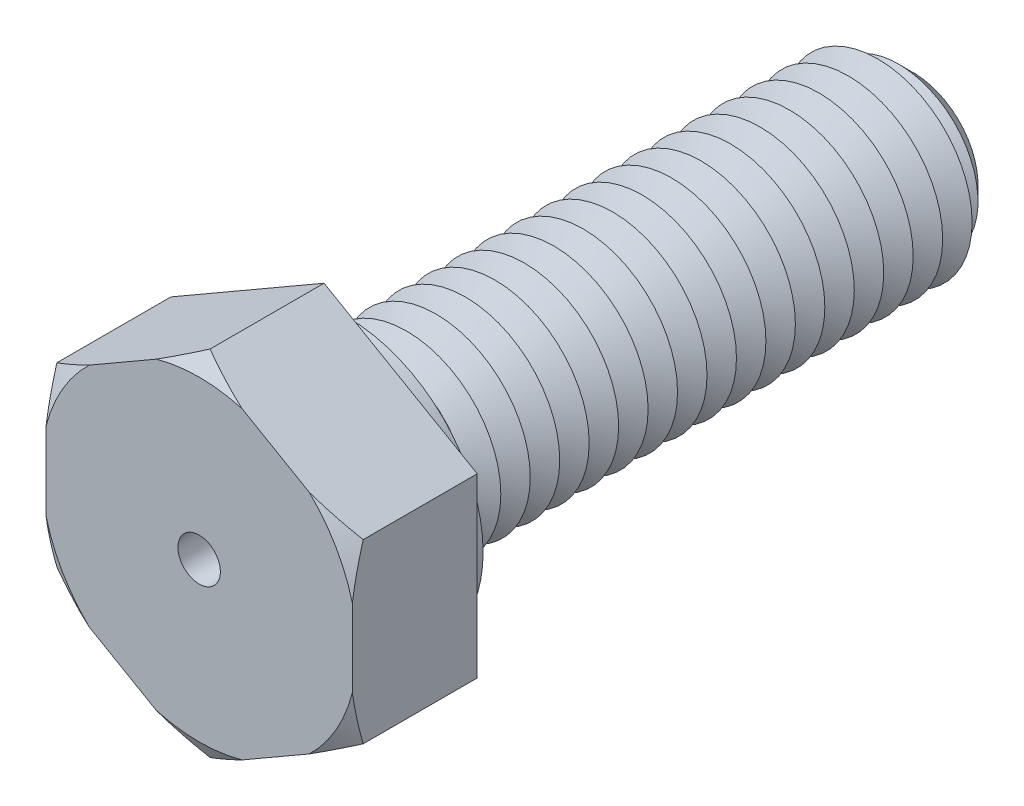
ISO-10303-21;
HEADER;
FILE_DESCRIPTION(('STEP AP214'),'2;1');
FILE_NAME('part.step','',(''),(''),'','','');
FILE_SCHEMA(('AUTOMOTIVE_DESIGN { 1 0 10303 214 1 1 1 1 }'));
ENDSEC;
DATA;
#1=APPLICATION_CONTEXT('core data for automotive mechanical design processes');
#2=APPLICATION_PROTOCOL_DEFINITION('international standard','automotive_design',2000,#1);
#3=PRODUCT_CONTEXT('',#1,'mechanical');
#4=PRODUCT('Part','Part','',(#3));
#5=PRODUCT_RELATED_PRODUCT_CATEGORY('part','',(#4));
#6=PRODUCT_DEFINITION_FORMATION('','',#4);
#7=PRODUCT_DEFINITION_CONTEXT('part definition',#1,'design');
#8=PRODUCT_DEFINITION('design','',#6,#7);
#9=PRODUCT_DEFINITION_SHAPE('','',#8);
#10=(LENGTH_UNIT() NAMED_UNIT(*) SI_UNIT(.MILLI.,.METRE.));
#11=(NAMED_UNIT(*) PLANE_ANGLE_UNIT() SI_UNIT($,.RADIAN.));
#12=(NAMED_UNIT(*) SI_UNIT($,.STERADIAN.) SOLID_ANGLE_UNIT());
#13=UNCERTAINTY_MEASURE_WITH_UNIT(LENGTH_MEASURE(1.E-05),#10,'distance_accuracy_value','');
#14=(GEOMETRIC_REPRESENTATION_CONTEXT(3) GLOBAL_UNCERTAINTY_ASSIGNED_CONTEXT((#13)) GLOBAL_UNIT_ASSIGNED_CONTEXT((#10,
#11,#12)) REPRESENTATION_CONTEXT('',''));
#15=CARTESIAN_POINT('',(0.,0.,0.));
#16=DIRECTION('',(0.,0.,1.));
#17=DIRECTION('',(1.,0.,0.));
#18=AXIS2_PLACEMENT_3D('',#15,#16,#17);
#19=CARTESIAN_POINT('',(6.5,3.75277674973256,5.3));
#20=DIRECTION('',(-0.5,-0.866025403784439,0.));
#21=DIRECTION('',(0.866025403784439,-0.5,0.));
#22=AXIS2_PLACEMENT_3D('',#19,#20,#21);
#23=PLANE('',#22);
#24=CARTESIAN_POINT('',(11.0120510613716,1.14774285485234,2.77920306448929));
#25=CARTESIAN_POINT('',(10.8078344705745,1.26564735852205,2.88939185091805));
#26=CARTESIAN_POINT('',(10.6031290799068,1.38383407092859,2.99839128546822));
#27=CARTESIAN_POINT('',(10.1925345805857,1.6208909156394,3.21345290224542));
#28=CARTESIAN_POINT('',(9.98664532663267,1.73976113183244,3.31951471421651));
#29=CARTESIAN_POINT('',(9.57286478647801,1.97865743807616,3.52844955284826));
#30=CARTESIAN_POINT('',(9.36496919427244,2.09868601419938,3.63131124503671));
#31=CARTESIAN_POINT('',(8.9476201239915,2.33964261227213,3.83272114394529));
#32=CARTESIAN_POINT('',(8.73816669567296,2.46057060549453,3.93126948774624));
#33=CARTESIAN_POINT('',(8.31210847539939,2.70655543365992,4.12554493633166));
#34=CARTESIAN_POINT('',(8.0954571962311,2.83163910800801,4.22113674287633));
#35=CARTESIAN_POINT('',(7.65996896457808,3.0830683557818,4.40550790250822));
#36=CARTESIAN_POINT('',(7.44113190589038,3.2094139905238,4.49428692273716));
#37=CARTESIAN_POINT('',(7.00122142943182,3.46339642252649,4.66334180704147));
#38=CARTESIAN_POINT('',(6.78015039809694,3.59103184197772,4.74362587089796));
#39=CARTESIAN_POINT('',(6.3354128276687,3.8478011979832,4.89383693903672));
#40=CARTESIAN_POINT('',(6.11174662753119,3.97693493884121,4.96376527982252));
#41=CARTESIAN_POINT('',(5.57683009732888,4.2857691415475,5.11501441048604));
#42=CARTESIAN_POINT('',(5.26433342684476,4.46618917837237,5.19069976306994));
#43=CARTESIAN_POINT('',(4.79238520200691,4.73866861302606,5.28165255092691));
#44=CARTESIAN_POINT('',(4.63453792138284,4.82980178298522,5.30820735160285));
#45=CARTESIAN_POINT('',(4.31797843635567,5.01256748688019,5.35312391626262));
#46=CARTESIAN_POINT('',(4.15926635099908,5.10419995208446,5.37148678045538));
#47=CARTESIAN_POINT('',(3.84309853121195,5.28673952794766,5.3993333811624));
#48=CARTESIAN_POINT('',(3.68564943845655,5.37764280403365,5.40891715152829));
#49=CARTESIAN_POINT('',(3.37053331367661,5.55957518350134,5.41928234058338));
#50=CARTESIAN_POINT('',(3.21286628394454,5.65060428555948,5.42006385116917));
#51=CARTESIAN_POINT('',(2.89768626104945,5.83257355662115,5.4127996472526));
#52=CARTESIAN_POINT('',(2.74017326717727,5.92351372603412,5.40475397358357));
#53=CARTESIAN_POINT('',(2.42563627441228,6.10511174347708,5.38007889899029));
#54=CARTESIAN_POINT('',(2.26861235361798,6.19576954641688,5.36344819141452));
#55=CARTESIAN_POINT('',(1.8976455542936,6.40994732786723,5.31443879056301));
#56=CARTESIAN_POINT('',(1.6840512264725,6.53326607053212,5.27851525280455));
#57=CARTESIAN_POINT('',(1.25890710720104,6.77872314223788,5.19313397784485));
#58=CARTESIAN_POINT('',(1.04735761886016,6.90086129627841,5.14367426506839));
#59=CARTESIAN_POINT('',(0.626329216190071,7.14394215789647,5.03308780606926));
#60=CARTESIAN_POINT('',(0.416852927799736,7.26488334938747,4.97194786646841));
#61=CARTESIAN_POINT('',(0.000251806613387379,7.50540811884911,4.83992704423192));
#62=CARTESIAN_POINT('',(-0.206873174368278,7.62499178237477,4.76904677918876));
#63=CARTESIAN_POINT('',(-0.621367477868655,7.86430018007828,4.61833709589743));
#64=CARTESIAN_POINT('',(-0.828710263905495,7.98400959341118,4.53841104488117));
#65=CARTESIAN_POINT('',(-1.2411992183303,8.22216020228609,4.3718486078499));
#66=CARTESIAN_POINT('',(-1.44634674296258,8.34060218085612,4.2852166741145));
#67=CARTESIAN_POINT('',(-1.85477207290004,8.57640665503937,4.10643213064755));
#68=CARTESIAN_POINT('',(-2.05805026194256,8.69376937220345,4.01428068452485));
#69=CARTESIAN_POINT('',(-2.46301289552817,8.92757465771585,3.82542322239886));
#70=CARTESIAN_POINT('',(-2.66469731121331,9.04401720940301,3.72871712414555));
#71=CARTESIAN_POINT('',(-3.00477721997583,9.24036243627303,3.56190249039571));
#72=CARTESIAN_POINT('',(-3.14353507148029,9.32047431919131,3.49277477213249));
#73=CARTESIAN_POINT('',(-3.42044427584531,9.48034792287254,3.35293264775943));
#74=CARTESIAN_POINT('',(-3.55859564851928,9.56010965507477,3.28221829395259));
#75=CARTESIAN_POINT('',(-3.83290330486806,9.71848125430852,3.14014092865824));
#76=CARTESIAN_POINT('',(-3.96906528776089,9.79709441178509,3.06879256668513));
#77=CARTESIAN_POINT('',(-4.24090766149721,9.9540426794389,2.92487520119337));
#78=CARTESIAN_POINT('',(-4.37658804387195,10.0323777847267,2.85230617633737));
#79=CARTESIAN_POINT('',(-4.5120510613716,10.1105873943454,2.77920306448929));
#80=B_SPLINE_CURVE_WITH_KNOTS('',3,(#24,#25,#26,#27,#28,#29,#30,#31,#32,#33,#34,#35,#36,#37,#38,
#39,#40,#41,#42,#43,#44,#45,#46,#47,#48,#49,#50,#51,#52,#53,#54,#55,#56,#57,#58,#59,#60,#61,#62,
#63,#64,#65,#66,#67,#68,#69,#70,#71,#72,#73,#74,#75,#76,#77,#78,#79),.UNSPECIFIED.,.F.,.F.,(4,2,
2,2,2,2,2,2,2,2,2,2,2,2,2,2,2,2,2,2,2,2,2,2,2,2,2,4),(0.,0.780858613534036,1.56181520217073,
2.34527979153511,3.12871946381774,3.93206444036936,4.73544864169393,5.53805016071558,
6.34054800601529,7.44542333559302,7.99784254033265,8.55018753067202,9.096157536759,
9.64212184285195,10.1880836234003,10.7341285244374,11.4813961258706,12.2287728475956,
12.9769988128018,13.7251773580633,14.4822772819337,15.2388787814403,15.9953213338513,
16.7517775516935,17.2752695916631,17.7987444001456,18.3167123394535,18.8346893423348),.UNSPECIFIED.);
#81=CARTESIAN_POINT('',(6.5,3.75277674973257,4.83811978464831));
#82=VERTEX_POINT('',#81);
#83=CARTESIAN_POINT('',(4.67682717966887,4.80538606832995,5.3));
#84=VERTEX_POINT('',#83);
#85=EDGE_CURVE('E132',#82,#84,#80,.T.);
#86=ORIENTED_EDGE('',*,*,#85,.F.);
#87=DIRECTION('',(0.,0.,-1.));
#88=VECTOR('',#87,1.);
#89=CARTESIAN_POINT('',(6.5,3.75277674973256,5.3));
#90=LINE('',#89,#88);
#91=CARTESIAN_POINT('',(6.5,3.75277674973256,0.));
#92=VERTEX_POINT('',#91);
#93=EDGE_CURVE('E144',#82,#92,#90,.T.);
#94=ORIENTED_EDGE('',*,*,#93,.T.);
#95=DIRECTION('',(-0.866025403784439,0.5,0.));
#96=VECTOR('',#95,1.);
#97=CARTESIAN_POINT('',(6.5,3.75277674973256,0.));
#98=LINE('',#97,#96);
#99=CARTESIAN_POINT('',(0.,7.50555349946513,0.));
#100=VERTEX_POINT('',#99);
#101=EDGE_CURVE('E354',#92,#100,#98,.T.);
#102=ORIENTED_EDGE('',*,*,#101,.T.);
#103=DIRECTION('',(0.,0.,-1.));
#104=VECTOR('',#103,1.);
#105=CARTESIAN_POINT('',(0.,7.50555349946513,5.3));
#106=LINE('',#105,#104);
#107=CARTESIAN_POINT('',(0.,7.50555349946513,4.83811978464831));
#108=VERTEX_POINT('',#107);
#109=EDGE_CURVE('E178',#108,#100,#106,.T.);
#110=ORIENTED_EDGE('',*,*,#109,.F.);
#111=CARTESIAN_POINT('',(1.82317282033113,6.45294418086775,5.3));
#112=VERTEX_POINT('',#111);
#113=EDGE_CURVE('E151',#112,#108,#80,.T.);
#114=ORIENTED_EDGE('',*,*,#113,.F.);
#115=DIRECTION('',(-0.866025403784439,0.5,0.));
#116=VECTOR('',#115,1.);
#117=CARTESIAN_POINT('',(6.5,3.75277674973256,5.3));
#118=LINE('',#117,#116);
#119=EDGE_CURVE('E148',#84,#112,#118,.T.);
#120=ORIENTED_EDGE('',*,*,#119,.F.);
#121=EDGE_LOOP('',(#86,#94,#102,#110,#114,#120));
#122=FACE_BOUND('',#121,.T.);
#123=ADVANCED_FACE('F39',(#122),#23,.F.);
#124=CARTESIAN_POINT('',(0.,7.50555349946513,5.3));
#125=DIRECTION('',(0.5,-0.866025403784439,0.));
#126=DIRECTION('',(0.866025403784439,0.5,0.));
#127=AXIS2_PLACEMENT_3D('',#124,#125,#126);
#128=PLANE('',#127);
#129=CARTESIAN_POINT('',(4.5120510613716,10.1105873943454,2.77920306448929));
#130=CARTESIAN_POINT('',(4.30783447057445,9.99268289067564,2.88939185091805));
#131=CARTESIAN_POINT('',(4.1031290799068,9.87449617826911,2.99839128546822));
#132=CARTESIAN_POINT('',(3.69253458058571,9.63743933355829,3.21345290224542));
#133=CARTESIAN_POINT('',(3.48664532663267,9.51856911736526,3.31951471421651));
#134=CARTESIAN_POINT('',(3.07286478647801,9.27967281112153,3.52844955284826));
#135=CARTESIAN_POINT('',(2.86496919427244,9.15964423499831,3.63131124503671));
#136=CARTESIAN_POINT('',(2.4476201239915,8.91868763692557,3.83272114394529));
#137=CARTESIAN_POINT('',(2.23816669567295,8.79775964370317,3.93126948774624));
#138=CARTESIAN_POINT('',(1.81210847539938,8.55177481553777,4.12554493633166));
#139=CARTESIAN_POINT('',(1.5954571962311,8.42669114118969,4.22113674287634));
#140=CARTESIAN_POINT('',(1.15996896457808,8.1752618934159,4.40550790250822));
#141=CARTESIAN_POINT('',(0.941131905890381,8.04891625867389,4.49428692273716));
#142=CARTESIAN_POINT('',(0.501221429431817,7.7949338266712,4.66334180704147));
#143=CARTESIAN_POINT('',(0.280150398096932,7.66729840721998,4.74362587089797));
#144=CARTESIAN_POINT('',(-0.164587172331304,7.4105290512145,4.89383693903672));
#145=CARTESIAN_POINT('',(-0.388253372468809,7.28139531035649,4.96376527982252));
#146=CARTESIAN_POINT('',(-0.923169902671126,6.9725611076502,5.11501441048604));
#147=CARTESIAN_POINT('',(-1.23566657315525,6.79214107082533,5.19069976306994));
#148=CARTESIAN_POINT('',(-1.70761479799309,6.51966163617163,5.28165255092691));
#149=CARTESIAN_POINT('',(-1.86546207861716,6.42852846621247,5.30820735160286));
#150=CARTESIAN_POINT('',(-2.18202156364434,6.24576276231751,5.35312391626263));
#151=CARTESIAN_POINT('',(-2.34073364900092,6.15413029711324,5.37148678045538));
#152=CARTESIAN_POINT('',(-2.65690146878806,5.97159072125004,5.3993333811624));
#153=CARTESIAN_POINT('',(-2.81435056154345,5.88068744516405,5.40891715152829));
#154=CARTESIAN_POINT('',(-3.12946668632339,5.69875506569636,5.41928234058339));
#155=CARTESIAN_POINT('',(-3.28713371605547,5.60772596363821,5.42006385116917));
#156=CARTESIAN_POINT('',(-3.60231373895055,5.42575669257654,5.4127996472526));
#157=CARTESIAN_POINT('',(-3.75982673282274,5.33481652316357,5.40475397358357));
#158=CARTESIAN_POINT('',(-4.07436372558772,5.15321850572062,5.38007889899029));
#159=CARTESIAN_POINT('',(-4.23138764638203,5.06256070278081,5.36344819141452));
#160=CARTESIAN_POINT('',(-4.60235444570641,4.84838292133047,5.31443879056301));
#161=CARTESIAN_POINT('',(-4.81594877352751,4.72506417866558,5.27851525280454));
#162=CARTESIAN_POINT('',(-5.24109289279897,4.47960710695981,5.19313397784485));
#163=CARTESIAN_POINT('',(-5.45264238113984,4.35746895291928,5.14367426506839));
#164=CARTESIAN_POINT('',(-5.87367078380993,4.11438809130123,5.03308780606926));
#165=CARTESIAN_POINT('',(-6.08314707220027,3.99344689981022,4.97194786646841));
#166=CARTESIAN_POINT('',(-6.49974819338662,3.75292213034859,4.83992704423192));
#167=CARTESIAN_POINT('',(-6.70687317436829,3.63333846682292,4.76904677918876));
#168=CARTESIAN_POINT('',(-7.12136747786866,3.39403006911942,4.61833709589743));
#169=CARTESIAN_POINT('',(-7.3287102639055,3.27432065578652,4.53841104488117));
#170=CARTESIAN_POINT('',(-7.74119921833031,3.03617004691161,4.3718486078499));
#171=CARTESIAN_POINT('',(-7.94634674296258,2.91772806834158,4.2852166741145));
#172=CARTESIAN_POINT('',(-8.35477207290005,2.68192359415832,4.10643213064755));
#173=CARTESIAN_POINT('',(-8.55805026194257,2.56456087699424,4.01428068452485));
#174=CARTESIAN_POINT('',(-8.96301289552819,2.33075559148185,3.82542322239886));
#175=CARTESIAN_POINT('',(-9.16469731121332,2.21431303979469,3.72871712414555));
#176=CARTESIAN_POINT('',(-9.50477721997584,2.01796781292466,3.5619024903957));
#177=CARTESIAN_POINT('',(-9.6435350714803,1.93785593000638,3.49277477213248));
#178=CARTESIAN_POINT('',(-9.92044427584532,1.77798232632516,3.35293264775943));
#179=CARTESIAN_POINT('',(-10.0585956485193,1.69822059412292,3.28221829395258));
#180=CARTESIAN_POINT('',(-10.3329033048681,1.53984899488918,3.14014092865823));
#181=CARTESIAN_POINT('',(-10.4690652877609,1.46123583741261,3.06879256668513));
#182=CARTESIAN_POINT('',(-10.7409076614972,1.3042875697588,2.92487520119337));
#183=CARTESIAN_POINT('',(-10.876588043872,1.225952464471,2.85230617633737));
#184=CARTESIAN_POINT('',(-11.0120510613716,1.14774285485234,2.77920306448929));
#185=B_SPLINE_CURVE_WITH_KNOTS('',3,(#129,#130,#131,#132,#133,#134,#135,#136,#137,#138,#139,
#140,#141,#142,#143,#144,#145,#146,#147,#148,#149,#150,#151,#152,#153,#154,#155,#156,#157,#158,
#159,#160,#161,#162,#163,#164,#165,#166,#167,#168,#169,#170,#171,#172,#173,#174,#175,#176,#177,
#178,#179,#180,#181,#182,#183,#184),.UNSPECIFIED.,.F.,.F.,(4,2,2,2,2,2,2,2,2,2,2,2,2,2,2,2,2,2,
2,2,2,2,2,2,2,2,2,4),(0.,0.780858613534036,1.56181520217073,2.34527979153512,3.12871946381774,
3.93206444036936,4.73544864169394,5.53805016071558,6.34054800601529,7.44542333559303,
7.99784254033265,8.55018753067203,9.096157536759,9.64212184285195,10.1880836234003,
10.7341285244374,11.4813961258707,12.2287728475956,12.9769988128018,13.7251773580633,
14.4822772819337,15.2388787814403,15.9953213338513,16.7517775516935,17.2752695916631,
17.7987444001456,18.3167123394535,18.8346893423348),.UNSPECIFIED.);
#186=CARTESIAN_POINT('',(-1.82317282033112,6.45294418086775,5.3));
#187=VERTEX_POINT('',#186);
#188=EDGE_CURVE('E1071',#108,#187,#185,.T.);
#189=ORIENTED_EDGE('',*,*,#188,.F.);
#190=ORIENTED_EDGE('',*,*,#109,.T.);
#191=DIRECTION('',(-0.866025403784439,-0.5,0.));
#192=VECTOR('',#191,1.);
#193=CARTESIAN_POINT('',(0.,7.50555349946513,0.));
#194=LINE('',#193,#192);
#195=CARTESIAN_POINT('',(-6.5,3.75277674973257,0.));
#196=VERTEX_POINT('',#195);
#197=EDGE_CURVE('E374',#100,#196,#194,.T.);
#198=ORIENTED_EDGE('',*,*,#197,.T.);
#199=DIRECTION('',(0.,0.,-1.));
#200=VECTOR('',#199,1.);
#201=CARTESIAN_POINT('',(-6.5,3.75277674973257,5.3));
#202=LINE('',#201,#200);
#203=CARTESIAN_POINT('',(-6.5,3.75277674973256,4.83811978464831));
#204=VERTEX_POINT('',#203);
#205=EDGE_CURVE('E175',#204,#196,#202,.T.);
#206=ORIENTED_EDGE('',*,*,#205,.F.);
#207=CARTESIAN_POINT('',(-4.67682717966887,4.80538606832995,5.3));
#208=VERTEX_POINT('',#207);
#209=EDGE_CURVE('E456',#208,#204,#185,.T.);
#210=ORIENTED_EDGE('',*,*,#209,.F.);
#211=DIRECTION('',(-0.866025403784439,-0.5,0.));
#212=VECTOR('',#211,1.);
#213=CARTESIAN_POINT('',(0.,7.50555349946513,5.3));
#214=LINE('',#213,#212);
#215=EDGE_CURVE('E357',#187,#208,#214,.T.);
#216=ORIENTED_EDGE('',*,*,#215,.F.);
#217=EDGE_LOOP('',(#189,#190,#198,#206,#210,#216));
#218=FACE_BOUND('',#217,.T.);
#219=ADVANCED_FACE('F465',(#218),#128,.F.);
#220=CARTESIAN_POINT('',(-6.5,3.75277674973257,5.3));
#221=DIRECTION('',(1.,0.,0.));
#222=DIRECTION('',(0.,0.,-1.));
#223=AXIS2_PLACEMENT_3D('',#220,#221,#222);
#224=PLANE('',#223);
#225=CARTESIAN_POINT('',(-6.5,8.26482781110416,3.10083044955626));
#226=CARTESIAN_POINT('',(-6.5,8.03000458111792,3.20736842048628));
#227=CARTESIAN_POINT('',(-6.5,7.79453887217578,3.31251727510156));
#228=CARTESIAN_POINT('',(-6.5,7.32204728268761,3.51936269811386));
#229=CARTESIAN_POINT('',(-6.5,7.08502112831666,3.62105864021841));
#230=CARTESIAN_POINT('',(-6.5,6.6082238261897,3.82070151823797));
#231=CARTESIAN_POINT('',(-6.5,6.36844534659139,3.91863101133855));
#232=CARTESIAN_POINT('',(-6.5,5.88686103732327,4.10935828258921));
#233=CARTESIAN_POINT('',(-6.5,5.64505530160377,4.20215629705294));
#234=CARTESIAN_POINT('',(-6.5,5.16020806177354,4.38107583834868));
#235=CARTESIAN_POINT('',(-6.5,4.91717698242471,4.46722547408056));
#236=CARTESIAN_POINT('',(-6.5,4.42851680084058,4.63190822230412));
#237=CARTESIAN_POINT('',(-6.5,4.18288757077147,4.71044095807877));
#238=CARTESIAN_POINT('',(-6.5,3.68915983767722,4.85808723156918));
#239=CARTESIAN_POINT('',(-6.5,3.44106517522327,4.9272135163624));
#240=CARTESIAN_POINT('',(-6.5,2.94198131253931,5.05420795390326));
#241=CARTESIAN_POINT('',(-6.5,2.69099223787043,5.1120765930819));
#242=CARTESIAN_POINT('',(-6.5,2.25769005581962,5.19995201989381));
#243=CARTESIAN_POINT('',(-6.5,2.07603591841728,5.23320954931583));
#244=CARTESIAN_POINT('',(-6.5,1.71151122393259,5.29207741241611));
#245=CARTESIAN_POINT('',(-6.5,1.52864087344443,5.31768901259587));
#246=CARTESIAN_POINT('',(-6.5,1.16195360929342,5.36059506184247));
#247=CARTESIAN_POINT('',(-6.5,0.978136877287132,5.37789105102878));
#248=CARTESIAN_POINT('',(-6.5,0.609880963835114,5.40367049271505));
#249=CARTESIAN_POINT('',(-6.5,0.425441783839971,5.41215396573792));
#250=CARTESIAN_POINT('',(-6.5,0.0564612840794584,5.42004368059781));
#251=CARTESIAN_POINT('',(-6.5,-0.128079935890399,5.41945454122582));
#252=CARTESIAN_POINT('',(-6.5,-0.49690745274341,5.40922941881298));
#253=CARTESIAN_POINT('',(-6.5,-0.681193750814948,5.39959347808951));
#254=CARTESIAN_POINT('',(-6.5,-1.04910266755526,5.37156866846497));
#255=CARTESIAN_POINT('',(-6.5,-1.23272526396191,5.35317950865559));
#256=CARTESIAN_POINT('',(-6.5,-1.5989735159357,5.30817918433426));
#257=CARTESIAN_POINT('',(-6.5,-1.78159898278,5.28156651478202));
#258=CARTESIAN_POINT('',(-6.5,-2.5090476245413,5.16009602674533));
#259=CARTESIAN_POINT('',(-6.5,-3.04897729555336,5.0350728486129));
#260=CARTESIAN_POINT('',(-6.5,-3.8489021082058,4.8122065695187));
#261=CARTESIAN_POINT('',(-6.5,-4.11422810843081,4.73189887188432));
#262=CARTESIAN_POINT('',(-6.5,-4.64182213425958,4.5617271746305));
#263=CARTESIAN_POINT('',(-6.5,-4.90409037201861,4.47186384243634));
#264=CARTESIAN_POINT('',(-6.5,-5.42881258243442,4.28339622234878));
#265=CARTESIAN_POINT('',(-6.5,-5.69123450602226,4.18470387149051));
#266=CARTESIAN_POINT('',(-6.5,-6.21363007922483,3.98100889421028));
#267=CARTESIAN_POINT('',(-6.5,-6.4736035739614,3.87600587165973));
#268=CARTESIAN_POINT('',(-6.5,-6.98982707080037,3.66159357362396));
#269=CARTESIAN_POINT('',(-6.5,-7.24609016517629,3.55221565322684));
#270=CARTESIAN_POINT('',(-6.5,-7.75676014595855,3.32937132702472));
#271=CARTESIAN_POINT('',(-6.5,-8.0111674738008,3.21590593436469));
#272=CARTESIAN_POINT('',(-6.5,-8.26482781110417,3.10083044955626));
#273=B_SPLINE_CURVE_WITH_KNOTS('',3,(#225,#226,#227,#228,#229,#230,#231,#232,#233,#234,#235,
#236,#237,#238,#239,#240,#241,#242,#243,#244,#245,#246,#247,#248,#249,#250,#251,#252,#253,#254,
#255,#256,#257,#258,#259,#260,#261,#262,#263,#264,#265,#266,#267,#268,#269,#270,#271,#272),
.UNSPECIFIED.,.F.,.F.,(4,2,2,2,2,2,2,2,2,2,2,2,2,2,2,2,2,2,2,2,2,2,2,4),(0.,0.773595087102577,
1.54732974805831,2.3242977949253,3.10123003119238,3.87467353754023,4.64815527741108,
5.42057817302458,6.19296768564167,6.74684672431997,7.30063396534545,7.85431860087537,
8.40800194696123,8.96140342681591,9.51480231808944,10.0682196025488,10.621738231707,
12.2804682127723,13.1120468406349,13.9435674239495,14.7845791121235,15.625643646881,
16.4614935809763,17.2971377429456),.UNSPECIFIED.);
#274=CARTESIAN_POINT('',(-6.5,1.64755811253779,5.3));
#275=VERTEX_POINT('',#274);
#276=EDGE_CURVE('E397',#204,#275,#273,.T.);
#277=ORIENTED_EDGE('',*,*,#276,.F.);
#278=ORIENTED_EDGE('',*,*,#205,.T.);
#279=DIRECTION('',(0.,-1.,0.));
#280=VECTOR('',#279,1.);
#281=CARTESIAN_POINT('',(-6.5,3.75277674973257,0.));
#282=LINE('',#281,#280);
#283=CARTESIAN_POINT('',(-6.5,-3.75277674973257,0.));
#284=VERTEX_POINT('',#283);
#285=EDGE_CURVE('E378',#196,#284,#282,.T.);
#286=ORIENTED_EDGE('',*,*,#285,.T.);
#287=DIRECTION('',(0.,0.,-1.));
#288=VECTOR('',#287,1.);
#289=CARTESIAN_POINT('',(-6.5,-3.75277674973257,5.3));
#290=LINE('',#289,#288);
#291=CARTESIAN_POINT('',(-6.49999999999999,-3.75277674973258,4.83811978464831));
#292=VERTEX_POINT('',#291);
#293=EDGE_CURVE('E172',#292,#284,#290,.T.);
#294=ORIENTED_EDGE('',*,*,#293,.F.);
#295=CARTESIAN_POINT('',(-6.5,-1.64755811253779,5.3));
#296=VERTEX_POINT('',#295);
#297=EDGE_CURVE('E396',#296,#292,#273,.T.);
#298=ORIENTED_EDGE('',*,*,#297,.F.);
#299=DIRECTION('',(0.,-1.,0.));
#300=VECTOR('',#299,1.);
#301=CARTESIAN_POINT('',(-6.5,3.75277674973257,5.3));
#302=LINE('',#301,#300);
#303=EDGE_CURVE('E361',#275,#296,#302,.T.);
#304=ORIENTED_EDGE('',*,*,#303,.F.);
#305=EDGE_LOOP('',(#277,#278,#286,#294,#298,#304));
#306=FACE_BOUND('',#305,.T.);
#307=ADVANCED_FACE('F461',(#306),#224,.F.);
#308=CARTESIAN_POINT('',(-6.5,-3.75277674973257,5.3));
#309=DIRECTION('',(0.5,0.866025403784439,0.));
#310=DIRECTION('',(-0.866025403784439,0.5,0.));
#311=AXIS2_PLACEMENT_3D('',#308,#309,#310);
#312=PLANE('',#311);
#313=CARTESIAN_POINT('',(-11.0120510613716,-1.14774285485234,2.77920306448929));
#314=CARTESIAN_POINT('',(-10.8078344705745,-1.26564735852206,2.88939185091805));
#315=CARTESIAN_POINT('',(-10.6031290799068,-1.3838340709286,2.99839128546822));
#316=CARTESIAN_POINT('',(-10.1925345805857,-1.62089091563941,3.21345290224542));
#317=CARTESIAN_POINT('',(-9.98664532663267,-1.73976113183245,3.31951471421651));
#318=CARTESIAN_POINT('',(-9.572864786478,-1.97865743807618,3.52844955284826));
#319=CARTESIAN_POINT('',(-9.36496919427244,-2.09868601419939,3.63131124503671));
#320=CARTESIAN_POINT('',(-8.94762012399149,-2.33964261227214,3.83272114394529));
#321=CARTESIAN_POINT('',(-8.73816669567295,-2.46057060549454,3.93126948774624));
#322=CARTESIAN_POINT('',(-8.31210847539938,-2.70655543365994,4.12554493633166));
#323=CARTESIAN_POINT('',(-8.0954571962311,-2.83163910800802,4.22113674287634));
#324=CARTESIAN_POINT('',(-7.65996896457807,-3.08306835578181,4.40550790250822));
#325=CARTESIAN_POINT('',(-7.44113190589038,-3.20941399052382,4.49428692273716));
#326=CARTESIAN_POINT('',(-7.00122142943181,-3.46339642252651,4.66334180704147));
#327=CARTESIAN_POINT('',(-6.78015039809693,-3.59103184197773,4.74362587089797));
#328=CARTESIAN_POINT('',(-6.33541282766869,-3.84780119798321,4.89383693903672));
#329=CARTESIAN_POINT('',(-6.11174662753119,-3.97693493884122,4.96376527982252));
#330=CARTESIAN_POINT('',(-5.57683009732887,-4.28576914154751,5.11501441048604));
#331=CARTESIAN_POINT('',(-5.26433342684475,-4.46618917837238,5.19069976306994));
#332=CARTESIAN_POINT('',(-4.7923852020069,-4.73866861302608,5.28165255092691));
#333=CARTESIAN_POINT('',(-4.63453792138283,-4.82980178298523,5.30820735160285));
#334=CARTESIAN_POINT('',(-4.31797843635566,-5.0125674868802,5.35312391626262));
#335=CARTESIAN_POINT('',(-4.15926635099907,-5.10419995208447,5.37148678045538));
#336=CARTESIAN_POINT('',(-3.84309853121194,-5.28673952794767,5.39933338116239));
#337=CARTESIAN_POINT('',(-3.68564943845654,-5.37764280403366,5.40891715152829));
#338=CARTESIAN_POINT('',(-3.3705333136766,-5.55957518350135,5.41928234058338));
#339=CARTESIAN_POINT('',(-3.21286628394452,-5.6506042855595,5.42006385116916));
#340=CARTESIAN_POINT('',(-2.89768626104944,-5.83257355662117,5.41279964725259));
#341=CARTESIAN_POINT('',(-2.74017326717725,-5.92351372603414,5.40475397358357));
#342=CARTESIAN_POINT('',(-2.42563627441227,-6.1051117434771,5.38007889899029));
#343=CARTESIAN_POINT('',(-2.26861235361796,-6.1957695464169,5.36344819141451));
#344=CARTESIAN_POINT('',(-1.89764555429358,-6.40994732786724,5.314438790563));
#345=CARTESIAN_POINT('',(-1.68405122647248,-6.53326607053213,5.27851525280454));
#346=CARTESIAN_POINT('',(-1.25890710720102,-6.7787231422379,5.19313397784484));
#347=CARTESIAN_POINT('',(-1.04735761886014,-6.90086129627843,5.14367426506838));
#348=CARTESIAN_POINT('',(-0.626329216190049,-7.14394215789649,5.03308780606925));
#349=CARTESIAN_POINT('',(-0.416852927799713,-7.26488334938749,4.9719478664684));
#350=CARTESIAN_POINT('',(-0.000251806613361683,-7.50540811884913,4.83992704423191));
#351=CARTESIAN_POINT('',(0.206873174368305,-7.62499178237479,4.76904677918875));
#352=CARTESIAN_POINT('',(0.621367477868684,-7.8643001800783,4.61833709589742));
#353=CARTESIAN_POINT('',(0.828710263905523,-7.9840095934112,4.53841104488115));
#354=CARTESIAN_POINT('',(1.24119921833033,-8.22216020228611,4.37184860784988));
#355=CARTESIAN_POINT('',(1.44634674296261,-8.34060218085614,4.28521667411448));
#356=CARTESIAN_POINT('',(1.85477207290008,-8.5764066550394,4.10643213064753));
#357=CARTESIAN_POINT('',(2.0580502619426,-8.69376937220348,4.01428068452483));
#358=CARTESIAN_POINT('',(2.46301289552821,-8.92757465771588,3.82542322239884));
#359=CARTESIAN_POINT('',(2.66469731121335,-9.04401720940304,3.72871712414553));
#360=CARTESIAN_POINT('',(3.00477721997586,-9.24036243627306,3.56190249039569));
#361=CARTESIAN_POINT('',(3.14353507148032,-9.32047431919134,3.49277477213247));
#362=CARTESIAN_POINT('',(3.42044427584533,-9.48034792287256,3.35293264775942));
#363=CARTESIAN_POINT('',(3.55859564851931,-9.56010965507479,3.28221829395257));
#364=CARTESIAN_POINT('',(3.83290330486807,-9.71848125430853,3.14014092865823));
#365=CARTESIAN_POINT('',(3.9690652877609,-9.7970944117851,3.06879256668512));
#366=CARTESIAN_POINT('',(4.24090766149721,-9.9540426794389,2.92487520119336));
#367=CARTESIAN_POINT('',(4.37658804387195,-10.0323777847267,2.85230617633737));
#368=CARTESIAN_POINT('',(4.51205106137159,-10.1105873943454,2.77920306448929));
#369=B_SPLINE_CURVE_WITH_KNOTS('',3,(#313,#314,#315,#316,#317,#318,#319,#320,#321,#322,#323,
#324,#325,#326,#327,#328,#329,#330,#331,#332,#333,#334,#335,#336,#337,#338,#339,#340,#341,#342,
#343,#344,#345,#346,#347,#348,#349,#350,#351,#352,#353,#354,#355,#356,#357,#358,#359,#360,#361,
#362,#363,#364,#365,#366,#367,#368),.UNSPECIFIED.,.F.,.F.,(4,2,2,2,2,2,2,2,2,2,2,2,2,2,2,2,2,2,
2,2,2,2,2,2,2,2,2,4),(0.,0.780858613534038,1.56181520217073,2.34527979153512,3.12871946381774,
3.93206444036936,4.73544864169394,5.53805016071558,6.3405480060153,7.44542333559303,
7.99784254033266,8.55018753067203,9.09615753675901,9.64212184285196,10.1880836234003,
10.7341285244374,11.4813961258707,12.2287728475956,12.9769988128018,13.7251773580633,
14.4822772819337,15.2388787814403,15.9953213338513,16.7517775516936,17.2752695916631,
17.7987444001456,18.3167123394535,18.8346893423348),.UNSPECIFIED.);
#370=CARTESIAN_POINT('',(-4.67682717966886,-4.80538606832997,5.3));
#371=VERTEX_POINT('',#370);
#372=EDGE_CURVE('E398',#292,#371,#369,.T.);
#373=ORIENTED_EDGE('',*,*,#372,.F.);
#374=ORIENTED_EDGE('',*,*,#293,.T.);
#375=DIRECTION('',(0.866025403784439,-0.5,0.));
#376=VECTOR('',#375,1.);
#377=CARTESIAN_POINT('',(-6.5,-3.75277674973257,0.));
#378=LINE('',#377,#376);
#379=CARTESIAN_POINT('',(0.,-7.50555349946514,0.));
#380=VERTEX_POINT('',#379);
#381=EDGE_CURVE('E382',#284,#380,#378,.T.);
#382=ORIENTED_EDGE('',*,*,#381,.T.);
#383=DIRECTION('',(0.,0.,-1.));
#384=VECTOR('',#383,1.);
#385=CARTESIAN_POINT('',(0.,-7.50555349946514,5.3));
#386=LINE('',#385,#384);
#387=CARTESIAN_POINT('',(0.,-7.50555349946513,4.83811978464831));
#388=VERTEX_POINT('',#387);
#389=EDGE_CURVE('E162',#388,#380,#386,.T.);
#390=ORIENTED_EDGE('',*,*,#389,.F.);
#391=CARTESIAN_POINT('',(-1.82317282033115,-6.45294418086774,5.3));
#392=VERTEX_POINT('',#391);
#393=EDGE_CURVE('E417',#392,#388,#369,.T.);
#394=ORIENTED_EDGE('',*,*,#393,.F.);
#395=DIRECTION('',(0.866025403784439,-0.5,0.));
#396=VECTOR('',#395,1.);
#397=CARTESIAN_POINT('',(-6.5,-3.75277674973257,5.3));
#398=LINE('',#397,#396);
#399=EDGE_CURVE('E365',#371,#392,#398,.T.);
#400=ORIENTED_EDGE('',*,*,#399,.F.);
#401=EDGE_LOOP('',(#373,#374,#382,#390,#394,#400));
#402=FACE_BOUND('',#401,.T.);
#403=ADVANCED_FACE('F464',(#402),#312,.F.);
#404=CARTESIAN_POINT('',(0.,-7.50555349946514,5.3));
#405=DIRECTION('',(-0.5,0.866025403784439,0.));
#406=DIRECTION('',(-0.866025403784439,-0.5,0.));
#407=AXIS2_PLACEMENT_3D('',#404,#405,#406);
#408=PLANE('',#407);
#409=CARTESIAN_POINT('',(-4.5120510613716,-10.1105873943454,2.77920306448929));
#410=CARTESIAN_POINT('',(-4.30783447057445,-9.99268289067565,2.88939185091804));
#411=CARTESIAN_POINT('',(-4.1031290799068,-9.87449617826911,2.99839128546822));
#412=CARTESIAN_POINT('',(-3.69253458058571,-9.6374393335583,3.21345290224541));
#413=CARTESIAN_POINT('',(-3.48664532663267,-9.51856911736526,3.3195147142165));
#414=CARTESIAN_POINT('',(-3.072864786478,-9.27967281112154,3.52844955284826));
#415=CARTESIAN_POINT('',(-2.86496919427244,-9.15964423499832,3.6313112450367));
#416=CARTESIAN_POINT('',(-2.4476201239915,-8.91868763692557,3.83272114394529));
#417=CARTESIAN_POINT('',(-2.23816669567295,-8.79775964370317,3.93126948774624));
#418=CARTESIAN_POINT('',(-1.81210847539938,-8.55177481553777,4.12554493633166));
#419=CARTESIAN_POINT('',(-1.5954571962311,-8.42669114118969,4.22113674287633));
#420=CARTESIAN_POINT('',(-1.15996896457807,-8.1752618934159,4.40550790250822));
#421=CARTESIAN_POINT('',(-0.941131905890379,-8.04891625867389,4.49428692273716));
#422=CARTESIAN_POINT('',(-0.501221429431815,-7.79493382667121,4.66334180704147));
#423=CARTESIAN_POINT('',(-0.28015039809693,-7.66729840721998,4.74362587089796));
#424=CARTESIAN_POINT('',(0.164587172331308,-7.4105290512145,4.89383693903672));
#425=CARTESIAN_POINT('',(0.388253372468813,-7.28139531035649,4.96376527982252));
#426=CARTESIAN_POINT('',(0.92316990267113,-6.9725611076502,5.11501441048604));
#427=CARTESIAN_POINT('',(1.23566657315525,-6.79214107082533,5.19069976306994));
#428=CARTESIAN_POINT('',(1.7076147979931,-6.51966163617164,5.28165255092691));
#429=CARTESIAN_POINT('',(1.86546207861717,-6.42852846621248,5.30820735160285));
#430=CARTESIAN_POINT('',(2.18202156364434,-6.24576276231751,5.35312391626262));
#431=CARTESIAN_POINT('',(2.34073364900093,-6.15413029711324,5.37148678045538));
#432=CARTESIAN_POINT('',(2.65690146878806,-5.97159072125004,5.3993333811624));
#433=CARTESIAN_POINT('',(2.81435056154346,-5.88068744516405,5.40891715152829));
#434=CARTESIAN_POINT('',(3.1294666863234,-5.69875506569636,5.41928234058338));
#435=CARTESIAN_POINT('',(3.28713371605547,-5.60772596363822,5.42006385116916));
#436=CARTESIAN_POINT('',(3.60231373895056,-5.42575669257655,5.41279964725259));
#437=CARTESIAN_POINT('',(3.75982673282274,-5.33481652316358,5.40475397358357));
#438=CARTESIAN_POINT('',(4.07436372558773,-5.15321850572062,5.38007889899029));
#439=CARTESIAN_POINT('',(4.23138764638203,-5.06256070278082,5.36344819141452));
#440=CARTESIAN_POINT('',(4.60235444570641,-4.84838292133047,5.31443879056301));
#441=CARTESIAN_POINT('',(4.81594877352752,-4.72506417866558,5.27851525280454));
#442=CARTESIAN_POINT('',(5.24109289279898,-4.47960710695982,5.19313397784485));
#443=CARTESIAN_POINT('',(5.45264238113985,-4.35746895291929,5.14367426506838));
#444=CARTESIAN_POINT('',(5.87367078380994,-4.11438809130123,5.03308780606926));
#445=CARTESIAN_POINT('',(6.08314707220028,-3.99344689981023,4.9719478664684));
#446=CARTESIAN_POINT('',(6.49974819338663,-3.75292213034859,4.83992704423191));
#447=CARTESIAN_POINT('',(6.7068731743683,-3.63333846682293,4.76904677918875));
#448=CARTESIAN_POINT('',(7.12136747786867,-3.39403006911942,4.61833709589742));
#449=CARTESIAN_POINT('',(7.32871026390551,-3.27432065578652,4.53841104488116));
#450=CARTESIAN_POINT('',(7.74119921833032,-3.03617004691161,4.37184860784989));
#451=CARTESIAN_POINT('',(7.9463467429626,-2.91772806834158,4.28521667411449));
#452=CARTESIAN_POINT('',(8.35477207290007,-2.68192359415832,4.10643213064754));
#453=CARTESIAN_POINT('',(8.55805026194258,-2.56456087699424,4.01428068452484));
#454=CARTESIAN_POINT('',(8.9630128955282,-2.33075559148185,3.82542322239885));
#455=CARTESIAN_POINT('',(9.16469731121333,-2.21431303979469,3.72871712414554));
#456=CARTESIAN_POINT('',(9.50477721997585,-2.01796781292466,3.56190249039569));
#457=CARTESIAN_POINT('',(9.64353507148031,-1.93785593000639,3.49277477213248));
#458=CARTESIAN_POINT('',(9.92044427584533,-1.77798232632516,3.35293264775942));
#459=CARTESIAN_POINT('',(10.0585956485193,-1.69822059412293,3.28221829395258));
#460=CARTESIAN_POINT('',(10.3329033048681,-1.53984899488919,3.14014092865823));
#461=CARTESIAN_POINT('',(10.4690652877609,-1.46123583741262,3.06879256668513));
#462=CARTESIAN_POINT('',(10.7409076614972,-1.30428756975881,2.92487520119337));
#463=CARTESIAN_POINT('',(10.876588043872,-1.22595246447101,2.85230617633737));
#464=CARTESIAN_POINT('',(11.0120510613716,-1.14774285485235,2.77920306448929));
#465=B_SPLINE_CURVE_WITH_KNOTS('',3,(#409,#410,#411,#412,#413,#414,#415,#416,#417,#418,#419,
#420,#421,#422,#423,#424,#425,#426,#427,#428,#429,#430,#431,#432,#433,#434,#435,#436,#437,#438,
#439,#440,#441,#442,#443,#444,#445,#446,#447,#448,#449,#450,#451,#452,#453,#454,#455,#456,#457,
#458,#459,#460,#461,#462,#463,#464),.UNSPECIFIED.,.F.,.F.,(4,2,2,2,2,2,2,2,2,2,2,2,2,2,2,2,2,2,
2,2,2,2,2,2,2,2,2,4),(0.,0.780858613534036,1.56181520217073,2.34527979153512,3.12871946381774,
3.93206444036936,4.73544864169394,5.53805016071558,6.3405480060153,7.44542333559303,
7.99784254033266,8.55018753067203,9.09615753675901,9.64212184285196,10.1880836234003,
10.7341285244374,11.4813961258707,12.2287728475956,12.9769988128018,13.7251773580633,
14.4822772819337,15.2388787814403,15.9953213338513,16.7517775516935,17.2752695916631,
17.7987444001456,18.3167123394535,18.8346893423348),.UNSPECIFIED.);
#466=CARTESIAN_POINT('',(1.82317282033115,-6.45294418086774,5.3));
#467=VERTEX_POINT('',#466);
#468=EDGE_CURVE('E64',#388,#467,#465,.T.);
#469=ORIENTED_EDGE('',*,*,#468,.F.);
#470=ORIENTED_EDGE('',*,*,#389,.T.);
#471=DIRECTION('',(0.866025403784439,0.5,0.));
#472=VECTOR('',#471,1.);
#473=CARTESIAN_POINT('',(0.,-7.50555349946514,0.));
#474=LINE('',#473,#472);
#475=CARTESIAN_POINT('',(6.5,-3.75277674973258,0.));
#476=VERTEX_POINT('',#475);
#477=EDGE_CURVE('E385',#380,#476,#474,.T.);
#478=ORIENTED_EDGE('',*,*,#477,.T.);
#479=DIRECTION('',(0.,0.,-1.));
#480=VECTOR('',#479,1.);
#481=CARTESIAN_POINT('',(6.5,-3.75277674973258,5.3));
#482=LINE('',#481,#480);
#483=CARTESIAN_POINT('',(6.5,-3.75277674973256,4.83811978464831));
#484=VERTEX_POINT('',#483);
#485=EDGE_CURVE('E157',#484,#476,#482,.T.);
#486=ORIENTED_EDGE('',*,*,#485,.F.);
#487=CARTESIAN_POINT('',(4.67682717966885,-4.80538606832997,5.3));
#488=VERTEX_POINT('',#487);
#489=EDGE_CURVE('E395',#488,#484,#465,.T.);
#490=ORIENTED_EDGE('',*,*,#489,.F.);
#491=DIRECTION('',(0.866025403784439,0.5,0.));
#492=VECTOR('',#491,1.);
#493=CARTESIAN_POINT('',(0.,-7.50555349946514,5.3));
#494=LINE('',#493,#492);
#495=EDGE_CURVE('E165',#467,#488,#494,.T.);
#496=ORIENTED_EDGE('',*,*,#495,.F.);
#497=EDGE_LOOP('',(#469,#470,#478,#486,#490,#496));
#498=FACE_BOUND('',#497,.T.);
#499=ADVANCED_FACE('F413',(#498),#408,.F.);
#500=CARTESIAN_POINT('',(6.5,-3.75277674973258,5.3));
#501=DIRECTION('',(-1.,0.,0.));
#502=DIRECTION('',(0.,-1.,0.));
#503=AXIS2_PLACEMENT_3D('',#500,#501,#502);
#504=PLANE('',#503);
#505=CARTESIAN_POINT('',(6.5,-8.26482781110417,3.10083044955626));
#506=CARTESIAN_POINT('',(6.5,-8.03000458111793,3.20736842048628));
#507=CARTESIAN_POINT('',(6.5,-7.79453887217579,3.31251727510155));
#508=CARTESIAN_POINT('',(6.5,-7.32204728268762,3.51936269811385));
#509=CARTESIAN_POINT('',(6.5,-7.08502112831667,3.62105864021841));
#510=CARTESIAN_POINT('',(6.5,-6.60822382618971,3.82070151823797));
#511=CARTESIAN_POINT('',(6.5,-6.3684453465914,3.91863101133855));
#512=CARTESIAN_POINT('',(6.5,-5.88686103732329,4.10935828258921));
#513=CARTESIAN_POINT('',(6.5,-5.64505530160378,4.20215629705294));
#514=CARTESIAN_POINT('',(6.5,-5.16020806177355,4.38107583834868));
#515=CARTESIAN_POINT('',(6.5,-4.91717698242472,4.46722547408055));
#516=CARTESIAN_POINT('',(6.5,-4.42851680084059,4.63190822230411));
#517=CARTESIAN_POINT('',(6.5,-4.18288757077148,4.71044095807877));
#518=CARTESIAN_POINT('',(6.5,-3.68915983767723,4.85808723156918));
#519=CARTESIAN_POINT('',(6.5,-3.44106517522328,4.9272135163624));
#520=CARTESIAN_POINT('',(6.5,-2.94198131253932,5.05420795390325));
#521=CARTESIAN_POINT('',(6.5,-2.69099223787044,5.1120765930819));
#522=CARTESIAN_POINT('',(6.5,-2.25769005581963,5.19995201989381));
#523=CARTESIAN_POINT('',(6.5,-2.07603591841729,5.23320954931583));
#524=CARTESIAN_POINT('',(6.5,-1.7115112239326,5.29207741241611));
#525=CARTESIAN_POINT('',(6.5,-1.52864087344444,5.31768901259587));
#526=CARTESIAN_POINT('',(6.5,-1.16195360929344,5.36059506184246));
#527=CARTESIAN_POINT('',(6.5,-0.978136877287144,5.37789105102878));
#528=CARTESIAN_POINT('',(6.5,-0.609880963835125,5.40367049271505));
#529=CARTESIAN_POINT('',(6.5,-0.425441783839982,5.41215396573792));
#530=CARTESIAN_POINT('',(6.5,-0.056461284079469,5.42004368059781));
#531=CARTESIAN_POINT('',(6.5,0.128079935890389,5.41945454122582));
#532=CARTESIAN_POINT('',(6.5,0.496907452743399,5.40922941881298));
#533=CARTESIAN_POINT('',(6.5,0.681193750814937,5.39959347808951));
#534=CARTESIAN_POINT('',(6.5,1.04910266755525,5.37156866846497));
#535=CARTESIAN_POINT('',(6.5,1.2327252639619,5.35317950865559));
#536=CARTESIAN_POINT('',(6.5,1.59897351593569,5.30817918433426));
#537=CARTESIAN_POINT('',(6.5,1.78159898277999,5.28156651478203));
#538=CARTESIAN_POINT('',(6.5,2.50904762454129,5.16009602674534));
#539=CARTESIAN_POINT('',(6.5,3.04897729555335,5.0350728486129));
#540=CARTESIAN_POINT('',(6.5,3.84890210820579,4.8122065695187));
#541=CARTESIAN_POINT('',(6.5,4.1142281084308,4.73189887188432));
#542=CARTESIAN_POINT('',(6.5,4.64182213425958,4.5617271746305));
#543=CARTESIAN_POINT('',(6.5,4.9040903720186,4.47186384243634));
#544=CARTESIAN_POINT('',(6.5,5.42881258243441,4.28339622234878));
#545=CARTESIAN_POINT('',(6.5,5.69123450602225,4.18470387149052));
#546=CARTESIAN_POINT('',(6.5,6.21363007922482,3.98100889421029));
#547=CARTESIAN_POINT('',(6.5,6.47360357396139,3.87600587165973));
#548=CARTESIAN_POINT('',(6.5,6.98982707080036,3.66159357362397));
#549=CARTESIAN_POINT('',(6.5,7.24609016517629,3.55221565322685));
#550=CARTESIAN_POINT('',(6.5,7.75676014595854,3.32937132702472));
#551=CARTESIAN_POINT('',(6.5,8.01116747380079,3.21590593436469));
#552=CARTESIAN_POINT('',(6.5,8.26482781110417,3.10083044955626));
#553=B_SPLINE_CURVE_WITH_KNOTS('',3,(#505,#506,#507,#508,#509,#510,#511,#512,#513,#514,#515,
#516,#517,#518,#519,#520,#521,#522,#523,#524,#525,#526,#527,#528,#529,#530,#531,#532,#533,#534,
#535,#536,#537,#538,#539,#540,#541,#542,#543,#544,#545,#546,#547,#548,#549,#550,#551,#552),
.UNSPECIFIED.,.F.,.F.,(4,2,2,2,2,2,2,2,2,2,2,2,2,2,2,2,2,2,2,2,2,2,2,4),(0.,0.773595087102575,
1.54732974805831,2.3242977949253,3.10123003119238,3.87467353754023,4.64815527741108,
5.42057817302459,6.19296768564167,6.74684672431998,7.30063396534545,7.85431860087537,
8.40800194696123,8.96140342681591,9.51480231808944,10.0682196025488,10.621738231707,
12.2804682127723,13.1120468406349,13.9435674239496,14.7845791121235,15.625643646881,
16.4614935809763,17.2971377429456),.UNSPECIFIED.);
#554=CARTESIAN_POINT('',(6.5,-1.64755811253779,5.3));
#555=VERTEX_POINT('',#554);
#556=EDGE_CURVE('E56',#484,#555,#553,.T.);
#557=ORIENTED_EDGE('',*,*,#556,.F.);
#558=ORIENTED_EDGE('',*,*,#485,.T.);
#559=DIRECTION('',(0.,1.,0.));
#560=VECTOR('',#559,1.);
#561=CARTESIAN_POINT('',(6.5,-3.75277674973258,0.));
#562=LINE('',#561,#560);
#563=EDGE_CURVE('E154',#476,#92,#562,.T.);
#564=ORIENTED_EDGE('',*,*,#563,.T.);
#565=ORIENTED_EDGE('',*,*,#93,.F.);
#566=CARTESIAN_POINT('',(6.5,1.64755811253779,5.3));
#567=VERTEX_POINT('',#566);
#568=EDGE_CURVE('E129',#567,#82,#553,.T.);
#569=ORIENTED_EDGE('',*,*,#568,.F.);
#570=DIRECTION('',(0.,1.,0.));
#571=VECTOR('',#570,1.);
#572=CARTESIAN_POINT('',(6.5,-3.75277674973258,5.3));
#573=LINE('',#572,#571);
#574=EDGE_CURVE('E158',#555,#567,#573,.T.);
#575=ORIENTED_EDGE('',*,*,#574,.F.);
#576=EDGE_LOOP('',(#557,#558,#564,#565,#569,#575));
#577=FACE_BOUND('',#576,.T.);
#578=ADVANCED_FACE('F152',(#577),#504,.F.);
#579=CARTESIAN_POINT('',(0.,0.,5.3));
#580=DIRECTION('',(0.,0.,1.));
#581=DIRECTION('',(1.,0.,0.));
#582=AXIS2_PLACEMENT_3D('',#579,#580,#581);
#583=PLANE('',#582);
#584=CARTESIAN_POINT('',(0.,0.,5.3));
#585=DIRECTION('',(0.,0.,1.));
#586=DIRECTION('',(1.,0.,0.));
#587=AXIS2_PLACEMENT_3D('',#584,#585,#586);
#588=CIRCLE('',#587,0.9);
#589=CARTESIAN_POINT('',(0.9,0.,5.3));
#590=VERTEX_POINT('',#589);
#591=EDGE_CURVE('E1060',#590,#590,#588,.T.);
#592=ORIENTED_EDGE('',*,*,#591,.F.);
#593=EDGE_LOOP('',(#592));
#594=FACE_BOUND('',#593,.T.);
#595=ORIENTED_EDGE('',*,*,#574,.T.);
#596=CARTESIAN_POINT('',(0.,0.,5.3));
#597=DIRECTION('',(0.,0.,1.));
#598=DIRECTION('',(1.,0.,0.));
#599=AXIS2_PLACEMENT_3D('',#596,#597,#598);
#600=CIRCLE('',#599,6.70555349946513);
#601=EDGE_CURVE('E134',#567,#84,#600,.T.);
#602=ORIENTED_EDGE('',*,*,#601,.T.);
#603=ORIENTED_EDGE('',*,*,#119,.T.);
#604=CARTESIAN_POINT('',(0.,0.,5.3));
#605=DIRECTION('',(0.,0.,1.));
#606=DIRECTION('',(1.,0.,0.));
#607=AXIS2_PLACEMENT_3D('',#604,#605,#606);
#608=CIRCLE('',#607,6.70555349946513);
#609=EDGE_CURVE('E11',#112,#187,#608,.T.);
#610=ORIENTED_EDGE('',*,*,#609,.T.);
#611=ORIENTED_EDGE('',*,*,#215,.T.);
#612=EDGE_CURVE('E49',#208,#275,#608,.T.);
#613=ORIENTED_EDGE('',*,*,#612,.T.);
#614=ORIENTED_EDGE('',*,*,#303,.T.);
#615=EDGE_CURVE('E402',#296,#371,#608,.T.);
#616=ORIENTED_EDGE('',*,*,#615,.T.);
#617=ORIENTED_EDGE('',*,*,#399,.T.);
#618=EDGE_CURVE('E405',#392,#467,#608,.T.);
#619=ORIENTED_EDGE('',*,*,#618,.T.);
#620=ORIENTED_EDGE('',*,*,#495,.T.);
#621=EDGE_CURVE('E43',#488,#555,#608,.T.);
#622=ORIENTED_EDGE('',*,*,#621,.T.);
#623=EDGE_LOOP('',(#595,#602,#603,#610,#611,#613,#614,#616,#617,#619,#620,#622));
#624=FACE_BOUND('',#623,.T.);
#625=ADVANCED_FACE('F411',(#594,#624),#583,.T.);
#626=CARTESIAN_POINT('',(0.,0.,0.));
#627=DIRECTION('',(0.,0.,1.));
#628=DIRECTION('',(1.,0.,0.));
#629=AXIS2_PLACEMENT_3D('',#626,#627,#628);
#630=PLANE('',#629);
#631=CARTESIAN_POINT('',(0.,0.,0.));
#632=DIRECTION('',(0.,0.,1.));
#633=DIRECTION('',(1.,0.,0.));
#634=AXIS2_PLACEMENT_3D('',#631,#632,#633);
#635=CIRCLE('',#634,5.75);
#636=CARTESIAN_POINT('',(5.75,0.,0.));
#637=VERTEX_POINT('',#636);
#638=EDGE_CURVE('E181',#637,#637,#635,.F.);
#639=ORIENTED_EDGE('',*,*,#638,.F.);
#640=EDGE_LOOP('',(#639));
#641=FACE_BOUND('',#640,.T.);
#642=ORIENTED_EDGE('',*,*,#101,.F.);
#643=ORIENTED_EDGE('',*,*,#563,.F.);
#644=ORIENTED_EDGE('',*,*,#477,.F.);
#645=ORIENTED_EDGE('',*,*,#381,.F.);
#646=ORIENTED_EDGE('',*,*,#285,.F.);
#647=ORIENTED_EDGE('',*,*,#197,.F.);
#648=EDGE_LOOP('',(#642,#643,#644,#645,#646,#647));
#649=FACE_BOUND('',#648,.T.);
#650=ADVANCED_FACE('F499',(#641,#649),#630,.F.);
#651=CARTESIAN_POINT('',(0.,0.,-1.));
#652=DIRECTION('',(0.,0.,1.));
#653=DIRECTION('',(1.,0.,0.));
#654=AXIS2_PLACEMENT_3D('',#651,#652,#653);
#655=CYLINDRICAL_SURFACE('',#654,5.75);
#656=CARTESIAN_POINT('',(0.,0.,-1.));
#657=DIRECTION('',(0.,0.,-1.));
#658=DIRECTION('',(-1.,0.,0.));
#659=AXIS2_PLACEMENT_3D('',#656,#657,#658);
#660=CIRCLE('',#659,5.75);
#661=CARTESIAN_POINT('',(-5.75,0.,-1.));
#662=VERTEX_POINT('',#661);
#663=EDGE_CURVE('E350',#662,#662,#660,.T.);
#664=ORIENTED_EDGE('',*,*,#663,.F.);
#665=EDGE_LOOP('',(#664));
#666=FACE_BOUND('',#665,.T.);
#667=ORIENTED_EDGE('',*,*,#638,.T.);
#668=EDGE_LOOP('',(#667));
#669=FACE_BOUND('',#668,.T.);
#670=ADVANCED_FACE('F506',(#666,#669),#655,.T.);
#671=CARTESIAN_POINT('',(0.,0.,-1.));
#672=DIRECTION('',(0.,0.,-1.));
#673=DIRECTION('',(-1.,0.,0.));
#674=AXIS2_PLACEMENT_3D('',#671,#672,#673);
#675=PLANE('',#674);
#676=CARTESIAN_POINT('',(0.,0.,-1.));
#677=DIRECTION('',(0.,0.,1.));
#678=DIRECTION('',(1.,0.,0.));
#679=AXIS2_PLACEMENT_3D('',#676,#677,#678);
#680=CIRCLE('',#679,4.);
#681=CARTESIAN_POINT('',(4.,0.,-1.));
#682=VERTEX_POINT('',#681);
#683=EDGE_CURVE('E346',#682,#682,#680,.T.);
#684=ORIENTED_EDGE('',*,*,#683,.T.);
#685=EDGE_LOOP('',(#684));
#686=FACE_BOUND('',#685,.T.);
#687=ORIENTED_EDGE('',*,*,#663,.T.);
#688=EDGE_LOOP('',(#687));
#689=FACE_BOUND('',#688,.T.);
#690=ADVANCED_FACE('F513',(#686,#689),#675,.T.);
#691=CARTESIAN_POINT('',(0.,0.,-1.));
#692=DIRECTION('',(0.,0.,1.));
#693=DIRECTION('',(1.,0.,0.));
#694=AXIS2_PLACEMENT_3D('',#691,#692,#693);
#695=CONICAL_SURFACE('',#694,4.,1.0471975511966);
#696=CARTESIAN_POINT('',(0.,0.,-1.625));
#697=DIRECTION('',(0.,0.,1.));
#698=DIRECTION('',(1.,0.,0.));
#699=AXIS2_PLACEMENT_3D('',#696,#697,#698);
#700=CIRCLE('',#699,2.91746824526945);
#701=CARTESIAN_POINT('',(2.91746824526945,0.,-1.625));
#702=VERTEX_POINT('',#701);
#703=EDGE_CURVE('E342',#702,#702,#700,.T.);
#704=ORIENTED_EDGE('',*,*,#703,.T.);
#705=EDGE_LOOP('',(#704));
#706=FACE_BOUND('',#705,.T.);
#707=ORIENTED_EDGE('',*,*,#683,.F.);
#708=EDGE_LOOP('',(#707));
#709=FACE_BOUND('',#708,.T.);
#710=ADVANCED_FACE('F520',(#706,#709),#695,.T.);
#711=CARTESIAN_POINT('',(0.,0.,-1.625));
#712=DIRECTION('',(0.,0.,-1.));
#713=DIRECTION('',(-1.,0.,0.));
#714=AXIS2_PLACEMENT_3D('',#711,#712,#713);
#715=CONICAL_SURFACE('',#714,2.91746824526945,1.0471975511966);
#716=CARTESIAN_POINT('',(0.,0.,-2.25));
#717=DIRECTION('',(0.,0.,1.));
#718=DIRECTION('',(1.,0.,0.));
#719=AXIS2_PLACEMENT_3D('',#716,#717,#718);
#720=CIRCLE('',#719,4.);
#721=CARTESIAN_POINT('',(4.,0.,-2.25));
#722=VERTEX_POINT('',#721);
#723=EDGE_CURVE('E338',#722,#722,#720,.T.);
#724=ORIENTED_EDGE('',*,*,#723,.T.);
#725=EDGE_LOOP('',(#724));
#726=FACE_BOUND('',#725,.T.);
#727=ORIENTED_EDGE('',*,*,#703,.F.);
#728=EDGE_LOOP('',(#727));
#729=FACE_BOUND('',#728,.T.);
#730=ADVANCED_FACE('F527',(#726,#729),#715,.T.);
#731=CARTESIAN_POINT('',(0.,0.,-2.25));
#732=DIRECTION('',(0.,0.,1.));
#733=DIRECTION('',(1.,0.,0.));
#734=AXIS2_PLACEMENT_3D('',#731,#732,#733);
#735=CONICAL_SURFACE('',#734,4.,1.0471975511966);
#736=CARTESIAN_POINT('',(0.,0.,-2.875));
#737=DIRECTION('',(0.,0.,1.));
#738=DIRECTION('',(1.,0.,0.));
#739=AXIS2_PLACEMENT_3D('',#736,#737,#738);
#740=CIRCLE('',#739,2.91746824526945);
#741=CARTESIAN_POINT('',(2.91746824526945,0.,-2.875));
#742=VERTEX_POINT('',#741);
#743=EDGE_CURVE('E334',#742,#742,#740,.T.);
#744=ORIENTED_EDGE('',*,*,#743,.T.);
#745=EDGE_LOOP('',(#744));
#746=FACE_BOUND('',#745,.T.);
#747=ORIENTED_EDGE('',*,*,#723,.F.);
#748=EDGE_LOOP('',(#747));
#749=FACE_BOUND('',#748,.T.);
#750=ADVANCED_FACE('F534',(#746,#749),#735,.T.);
#751=CARTESIAN_POINT('',(0.,0.,-2.875));
#752=DIRECTION('',(0.,0.,-1.));
#753=DIRECTION('',(-1.,0.,0.));
#754=AXIS2_PLACEMENT_3D('',#751,#752,#753);
#755=CONICAL_SURFACE('',#754,2.91746824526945,1.0471975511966);
#756=CARTESIAN_POINT('',(0.,0.,-3.5));
#757=DIRECTION('',(0.,0.,1.));
#758=DIRECTION('',(1.,0.,0.));
#759=AXIS2_PLACEMENT_3D('',#756,#757,#758);
#760=CIRCLE('',#759,4.);
#761=CARTESIAN_POINT('',(4.,0.,-3.5));
#762=VERTEX_POINT('',#761);
#763=EDGE_CURVE('E330',#762,#762,#760,.T.);
#764=ORIENTED_EDGE('',*,*,#763,.T.);
#765=EDGE_LOOP('',(#764));
#766=FACE_BOUND('',#765,.T.);
#767=ORIENTED_EDGE('',*,*,#743,.F.);
#768=EDGE_LOOP('',(#767));
#769=FACE_BOUND('',#768,.T.);
#770=ADVANCED_FACE('F541',(#766,#769),#755,.T.);
#771=CARTESIAN_POINT('',(0.,0.,-3.5));
#772=DIRECTION('',(0.,0.,1.));
#773=DIRECTION('',(1.,0.,0.));
#774=AXIS2_PLACEMENT_3D('',#771,#772,#773);
#775=CONICAL_SURFACE('',#774,4.,1.0471975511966);
#776=CARTESIAN_POINT('',(0.,0.,-4.125));
#777=DIRECTION('',(0.,0.,1.));
#778=DIRECTION('',(1.,0.,0.));
#779=AXIS2_PLACEMENT_3D('',#776,#777,#778);
#780=CIRCLE('',#779,2.91746824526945);
#781=CARTESIAN_POINT('',(2.91746824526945,0.,-4.125));
#782=VERTEX_POINT('',#781);
#783=EDGE_CURVE('E326',#782,#782,#780,.T.);
#784=ORIENTED_EDGE('',*,*,#783,.T.);
#785=EDGE_LOOP('',(#784));
#786=FACE_BOUND('',#785,.T.);
#787=ORIENTED_EDGE('',*,*,#763,.F.);
#788=EDGE_LOOP('',(#787));
#789=FACE_BOUND('',#788,.T.);
#790=ADVANCED_FACE('F548',(#786,#789),#775,.T.);
#791=CARTESIAN_POINT('',(0.,0.,-4.125));
#792=DIRECTION('',(0.,0.,-1.));
#793=DIRECTION('',(-1.,0.,0.));
#794=AXIS2_PLACEMENT_3D('',#791,#792,#793);
#795=CONICAL_SURFACE('',#794,2.91746824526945,1.0471975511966);
#796=CARTESIAN_POINT('',(0.,0.,-4.75));
#797=DIRECTION('',(0.,0.,1.));
#798=DIRECTION('',(1.,0.,0.));
#799=AXIS2_PLACEMENT_3D('',#796,#797,#798);
#800=CIRCLE('',#799,4.);
#801=CARTESIAN_POINT('',(4.,0.,-4.75));
#802=VERTEX_POINT('',#801);
#803=EDGE_CURVE('E322',#802,#802,#800,.T.);
#804=ORIENTED_EDGE('',*,*,#803,.T.);
#805=EDGE_LOOP('',(#804));
#806=FACE_BOUND('',#805,.T.);
#807=ORIENTED_EDGE('',*,*,#783,.F.);
#808=EDGE_LOOP('',(#807));
#809=FACE_BOUND('',#808,.T.);
#810=ADVANCED_FACE('F555',(#806,#809),#795,.T.);
#811=CARTESIAN_POINT('',(0.,0.,-4.75));
#812=DIRECTION('',(0.,0.,1.));
#813=DIRECTION('',(1.,0.,0.));
#814=AXIS2_PLACEMENT_3D('',#811,#812,#813);
#815=CONICAL_SURFACE('',#814,4.,1.0471975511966);
#816=CARTESIAN_POINT('',(0.,0.,-5.375));
#817=DIRECTION('',(0.,0.,1.));
#818=DIRECTION('',(1.,0.,0.));
#819=AXIS2_PLACEMENT_3D('',#816,#817,#818);
#820=CIRCLE('',#819,2.91746824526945);
#821=CARTESIAN_POINT('',(2.91746824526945,0.,-5.375));
#822=VERTEX_POINT('',#821);
#823=EDGE_CURVE('E318',#822,#822,#820,.T.);
#824=ORIENTED_EDGE('',*,*,#823,.T.);
#825=EDGE_LOOP('',(#824));
#826=FACE_BOUND('',#825,.T.);
#827=ORIENTED_EDGE('',*,*,#803,.F.);
#828=EDGE_LOOP('',(#827));
#829=FACE_BOUND('',#828,.T.);
#830=ADVANCED_FACE('F562',(#826,#829),#815,.T.);
#831=CARTESIAN_POINT('',(0.,0.,-5.375));
#832=DIRECTION('',(0.,0.,-1.));
#833=DIRECTION('',(-1.,0.,0.));
#834=AXIS2_PLACEMENT_3D('',#831,#832,#833);
#835=CONICAL_SURFACE('',#834,2.91746824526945,1.0471975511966);
#836=CARTESIAN_POINT('',(0.,0.,-6.));
#837=DIRECTION('',(0.,0.,1.));
#838=DIRECTION('',(1.,0.,0.));
#839=AXIS2_PLACEMENT_3D('',#836,#837,#838);
#840=CIRCLE('',#839,4.);
#841=CARTESIAN_POINT('',(4.,0.,-6.));
#842=VERTEX_POINT('',#841);
#843=EDGE_CURVE('E314',#842,#842,#840,.T.);
#844=ORIENTED_EDGE('',*,*,#843,.T.);
#845=EDGE_LOOP('',(#844));
#846=FACE_BOUND('',#845,.T.);
#847=ORIENTED_EDGE('',*,*,#823,.F.);
#848=EDGE_LOOP('',(#847));
#849=FACE_BOUND('',#848,.T.);
#850=ADVANCED_FACE('F569',(#846,#849),#835,.T.);
#851=CARTESIAN_POINT('',(0.,0.,-6.));
#852=DIRECTION('',(0.,0.,1.));
#853=DIRECTION('',(1.,0.,0.));
#854=AXIS2_PLACEMENT_3D('',#851,#852,#853);
#855=CONICAL_SURFACE('',#854,4.,1.0471975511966);
#856=CARTESIAN_POINT('',(0.,0.,-6.625));
#857=DIRECTION('',(0.,0.,1.));
#858=DIRECTION('',(1.,0.,0.));
#859=AXIS2_PLACEMENT_3D('',#856,#857,#858);
#860=CIRCLE('',#859,2.91746824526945);
#861=CARTESIAN_POINT('',(2.91746824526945,0.,-6.625));
#862=VERTEX_POINT('',#861);
#863=EDGE_CURVE('E310',#862,#862,#860,.T.);
#864=ORIENTED_EDGE('',*,*,#863,.T.);
#865=EDGE_LOOP('',(#864));
#866=FACE_BOUND('',#865,.T.);
#867=ORIENTED_EDGE('',*,*,#843,.F.);
#868=EDGE_LOOP('',(#867));
#869=FACE_BOUND('',#868,.T.);
#870=ADVANCED_FACE('F576',(#866,#869),#855,.T.);
#871=CARTESIAN_POINT('',(0.,0.,-6.625));
#872=DIRECTION('',(0.,0.,-1.));
#873=DIRECTION('',(-1.,0.,0.));
#874=AXIS2_PLACEMENT_3D('',#871,#872,#873);
#875=CONICAL_SURFACE('',#874,2.91746824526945,1.0471975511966);
#876=CARTESIAN_POINT('',(0.,0.,-7.25));
#877=DIRECTION('',(0.,0.,1.));
#878=DIRECTION('',(1.,0.,0.));
#879=AXIS2_PLACEMENT_3D('',#876,#877,#878);
#880=CIRCLE('',#879,4.);
#881=CARTESIAN_POINT('',(4.,0.,-7.25));
#882=VERTEX_POINT('',#881);
#883=EDGE_CURVE('E306',#882,#882,#880,.T.);
#884=ORIENTED_EDGE('',*,*,#883,.T.);
#885=EDGE_LOOP('',(#884));
#886=FACE_BOUND('',#885,.T.);
#887=ORIENTED_EDGE('',*,*,#863,.F.);
#888=EDGE_LOOP('',(#887));
#889=FACE_BOUND('',#888,.T.);
#890=ADVANCED_FACE('F583',(#886,#889),#875,.T.);
#891=CARTESIAN_POINT('',(0.,0.,-7.25));
#892=DIRECTION('',(0.,0.,1.));
#893=DIRECTION('',(1.,0.,0.));
#894=AXIS2_PLACEMENT_3D('',#891,#892,#893);
#895=CONICAL_SURFACE('',#894,4.,1.0471975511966);
#896=CARTESIAN_POINT('',(0.,0.,-7.875));
#897=DIRECTION('',(0.,0.,1.));
#898=DIRECTION('',(1.,0.,0.));
#899=AXIS2_PLACEMENT_3D('',#896,#897,#898);
#900=CIRCLE('',#899,2.91746824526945);
#901=CARTESIAN_POINT('',(2.91746824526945,0.,-7.875));
#902=VERTEX_POINT('',#901);
#903=EDGE_CURVE('E302',#902,#902,#900,.T.);
#904=ORIENTED_EDGE('',*,*,#903,.T.);
#905=EDGE_LOOP('',(#904));
#906=FACE_BOUND('',#905,.T.);
#907=ORIENTED_EDGE('',*,*,#883,.F.);
#908=EDGE_LOOP('',(#907));
#909=FACE_BOUND('',#908,.T.);
#910=ADVANCED_FACE('F590',(#906,#909),#895,.T.);
#911=CARTESIAN_POINT('',(0.,0.,-7.875));
#912=DIRECTION('',(0.,0.,-1.));
#913=DIRECTION('',(-1.,0.,0.));
#914=AXIS2_PLACEMENT_3D('',#911,#912,#913);
#915=CONICAL_SURFACE('',#914,2.91746824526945,1.0471975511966);
#916=CARTESIAN_POINT('',(0.,0.,-8.5));
#917=DIRECTION('',(0.,0.,1.));
#918=DIRECTION('',(1.,0.,0.));
#919=AXIS2_PLACEMENT_3D('',#916,#917,#918);
#920=CIRCLE('',#919,4.);
#921=CARTESIAN_POINT('',(4.,0.,-8.5));
#922=VERTEX_POINT('',#921);
#923=EDGE_CURVE('E298',#922,#922,#920,.T.);
#924=ORIENTED_EDGE('',*,*,#923,.T.);
#925=EDGE_LOOP('',(#924));
#926=FACE_BOUND('',#925,.T.);
#927=ORIENTED_EDGE('',*,*,#903,.F.);
#928=EDGE_LOOP('',(#927));
#929=FACE_BOUND('',#928,.T.);
#930=ADVANCED_FACE('F597',(#926,#929),#915,.T.);
#931=CARTESIAN_POINT('',(0.,0.,-8.5));
#932=DIRECTION('',(0.,0.,1.));
#933=DIRECTION('',(1.,0.,0.));
#934=AXIS2_PLACEMENT_3D('',#931,#932,#933);
#935=CONICAL_SURFACE('',#934,4.,1.0471975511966);
#936=CARTESIAN_POINT('',(0.,0.,-9.125));
#937=DIRECTION('',(0.,0.,1.));
#938=DIRECTION('',(1.,0.,0.));
#939=AXIS2_PLACEMENT_3D('',#936,#937,#938);
#940=CIRCLE('',#939,2.91746824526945);
#941=CARTESIAN_POINT('',(2.91746824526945,0.,-9.125));
#942=VERTEX_POINT('',#941);
#943=EDGE_CURVE('E294',#942,#942,#940,.T.);
#944=ORIENTED_EDGE('',*,*,#943,.T.);
#945=EDGE_LOOP('',(#944));
#946=FACE_BOUND('',#945,.T.);
#947=ORIENTED_EDGE('',*,*,#923,.F.);
#948=EDGE_LOOP('',(#947));
#949=FACE_BOUND('',#948,.T.);
#950=ADVANCED_FACE('F604',(#946,#949),#935,.T.);
#951=CARTESIAN_POINT('',(0.,0.,-9.125));
#952=DIRECTION('',(0.,0.,-1.));
#953=DIRECTION('',(-1.,0.,0.));
#954=AXIS2_PLACEMENT_3D('',#951,#952,#953);
#955=CONICAL_SURFACE('',#954,2.91746824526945,1.0471975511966);
#956=CARTESIAN_POINT('',(0.,0.,-9.75));
#957=DIRECTION('',(0.,0.,1.));
#958=DIRECTION('',(1.,0.,0.));
#959=AXIS2_PLACEMENT_3D('',#956,#957,#958);
#960=CIRCLE('',#959,4.);
#961=CARTESIAN_POINT('',(4.,0.,-9.75));
#962=VERTEX_POINT('',#961);
#963=EDGE_CURVE('E290',#962,#962,#960,.T.);
#964=ORIENTED_EDGE('',*,*,#963,.T.);
#965=EDGE_LOOP('',(#964));
#966=FACE_BOUND('',#965,.T.);
#967=ORIENTED_EDGE('',*,*,#943,.F.);
#968=EDGE_LOOP('',(#967));
#969=FACE_BOUND('',#968,.T.);
#970=ADVANCED_FACE('F611',(#966,#969),#955,.T.);
#971=CARTESIAN_POINT('',(0.,0.,-9.75));
#972=DIRECTION('',(0.,0.,1.));
#973=DIRECTION('',(1.,0.,0.));
#974=AXIS2_PLACEMENT_3D('',#971,#972,#973);
#975=CONICAL_SURFACE('',#974,4.,1.0471975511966);
#976=CARTESIAN_POINT('',(0.,0.,-10.375));
#977=DIRECTION('',(0.,0.,1.));
#978=DIRECTION('',(1.,0.,0.));
#979=AXIS2_PLACEMENT_3D('',#976,#977,#978);
#980=CIRCLE('',#979,2.91746824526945);
#981=CARTESIAN_POINT('',(2.91746824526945,0.,-10.375));
#982=VERTEX_POINT('',#981);
#983=EDGE_CURVE('E287',#982,#982,#980,.T.);
#984=ORIENTED_EDGE('',*,*,#983,.T.);
#985=EDGE_LOOP('',(#984));
#986=FACE_BOUND('',#985,.T.);
#987=ORIENTED_EDGE('',*,*,#963,.F.);
#988=EDGE_LOOP('',(#987));
#989=FACE_BOUND('',#988,.T.);
#990=ADVANCED_FACE('F618',(#986,#989),#975,.T.);
#991=CARTESIAN_POINT('',(0.,0.,-10.375));
#992=DIRECTION('',(0.,0.,-1.));
#993=DIRECTION('',(-1.,0.,0.));
#994=AXIS2_PLACEMENT_3D('',#991,#992,#993);
#995=CONICAL_SURFACE('',#994,2.91746824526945,1.0471975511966);
#996=CARTESIAN_POINT('',(0.,0.,-11.));
#997=DIRECTION('',(0.,0.,1.));
#998=DIRECTION('',(1.,0.,0.));
#999=AXIS2_PLACEMENT_3D('',#996,#997,#998);
#1000=CIRCLE('',#999,4.);
#1001=CARTESIAN_POINT('',(4.,0.,-11.));
#1002=VERTEX_POINT('',#1001);
#1003=EDGE_CURVE('E283',#1002,#1002,#1000,.T.);
#1004=ORIENTED_EDGE('',*,*,#1003,.T.);
#1005=EDGE_LOOP('',(#1004));
#1006=FACE_BOUND('',#1005,.T.);
#1007=ORIENTED_EDGE('',*,*,#983,.F.);
#1008=EDGE_LOOP('',(#1007));
#1009=FACE_BOUND('',#1008,.T.);
#1010=ADVANCED_FACE('F625',(#1006,#1009),#995,.T.);
#1011=CARTESIAN_POINT('',(0.,0.,-11.));
#1012=DIRECTION('',(0.,0.,1.));
#1013=DIRECTION('',(1.,0.,0.));
#1014=AXIS2_PLACEMENT_3D('',#1011,#1012,#1013);
#1015=CONICAL_SURFACE('',#1014,4.,1.0471975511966);
#1016=CARTESIAN_POINT('',(0.,0.,-11.625));
#1017=DIRECTION('',(0.,0.,1.));
#1018=DIRECTION('',(1.,0.,0.));
#1019=AXIS2_PLACEMENT_3D('',#1016,#1017,#1018);
#1020=CIRCLE('',#1019,2.91746824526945);
#1021=CARTESIAN_POINT('',(2.91746824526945,0.,-11.625));
#1022=VERTEX_POINT('',#1021);
#1023=EDGE_CURVE('E279',#1022,#1022,#1020,.T.);
#1024=ORIENTED_EDGE('',*,*,#1023,.T.);
#1025=EDGE_LOOP('',(#1024));
#1026=FACE_BOUND('',#1025,.T.);
#1027=ORIENTED_EDGE('',*,*,#1003,.F.);
#1028=EDGE_LOOP('',(#1027));
#1029=FACE_BOUND('',#1028,.T.);
#1030=ADVANCED_FACE('F632',(#1026,#1029),#1015,.T.);
#1031=CARTESIAN_POINT('',(0.,0.,-11.625));
#1032=DIRECTION('',(0.,0.,-1.));
#1033=DIRECTION('',(-1.,0.,0.));
#1034=AXIS2_PLACEMENT_3D('',#1031,#1032,#1033);
#1035=CONICAL_SURFACE('',#1034,2.91746824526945,1.0471975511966);
#1036=CARTESIAN_POINT('',(0.,0.,-12.25));
#1037=DIRECTION('',(0.,0.,1.));
#1038=DIRECTION('',(1.,0.,0.));
#1039=AXIS2_PLACEMENT_3D('',#1036,#1037,#1038);
#1040=CIRCLE('',#1039,4.);
#1041=CARTESIAN_POINT('',(4.,0.,-12.25));
#1042=VERTEX_POINT('',#1041);
#1043=EDGE_CURVE('E275',#1042,#1042,#1040,.T.);
#1044=ORIENTED_EDGE('',*,*,#1043,.T.);
#1045=EDGE_LOOP('',(#1044));
#1046=FACE_BOUND('',#1045,.T.);
#1047=ORIENTED_EDGE('',*,*,#1023,.F.);
#1048=EDGE_LOOP('',(#1047));
#1049=FACE_BOUND('',#1048,.T.);
#1050=ADVANCED_FACE('F639',(#1046,#1049),#1035,.T.);
#1051=CARTESIAN_POINT('',(0.,0.,-12.25));
#1052=DIRECTION('',(0.,0.,1.));
#1053=DIRECTION('',(1.,0.,0.));
#1054=AXIS2_PLACEMENT_3D('',#1051,#1052,#1053);
#1055=CONICAL_SURFACE('',#1054,4.,1.0471975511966);
#1056=CARTESIAN_POINT('',(0.,0.,-12.875));
#1057=DIRECTION('',(0.,0.,1.));
#1058=DIRECTION('',(1.,0.,0.));
#1059=AXIS2_PLACEMENT_3D('',#1056,#1057,#1058);
#1060=CIRCLE('',#1059,2.91746824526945);
#1061=CARTESIAN_POINT('',(2.91746824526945,0.,-12.875));
#1062=VERTEX_POINT('',#1061);
#1063=EDGE_CURVE('E271',#1062,#1062,#1060,.T.);
#1064=ORIENTED_EDGE('',*,*,#1063,.T.);
#1065=EDGE_LOOP('',(#1064));
#1066=FACE_BOUND('',#1065,.T.);
#1067=ORIENTED_EDGE('',*,*,#1043,.F.);
#1068=EDGE_LOOP('',(#1067));
#1069=FACE_BOUND('',#1068,.T.);
#1070=ADVANCED_FACE('F646',(#1066,#1069),#1055,.T.);
#1071=CARTESIAN_POINT('',(0.,0.,-12.875));
#1072=DIRECTION('',(0.,0.,-1.));
#1073=DIRECTION('',(-1.,0.,0.));
#1074=AXIS2_PLACEMENT_3D('',#1071,#1072,#1073);
#1075=CONICAL_SURFACE('',#1074,2.91746824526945,1.0471975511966);
#1076=CARTESIAN_POINT('',(0.,0.,-13.5));
#1077=DIRECTION('',(0.,0.,1.));
#1078=DIRECTION('',(1.,0.,0.));
#1079=AXIS2_PLACEMENT_3D('',#1076,#1077,#1078);
#1080=CIRCLE('',#1079,4.);
#1081=CARTESIAN_POINT('',(4.,0.,-13.5));
#1082=VERTEX_POINT('',#1081);
#1083=EDGE_CURVE('E267',#1082,#1082,#1080,.T.);
#1084=ORIENTED_EDGE('',*,*,#1083,.T.);
#1085=EDGE_LOOP('',(#1084));
#1086=FACE_BOUND('',#1085,.T.);
#1087=ORIENTED_EDGE('',*,*,#1063,.F.);
#1088=EDGE_LOOP('',(#1087));
#1089=FACE_BOUND('',#1088,.T.);
#1090=ADVANCED_FACE('F653',(#1086,#1089),#1075,.T.);
#1091=CARTESIAN_POINT('',(0.,0.,-13.5));
#1092=DIRECTION('',(0.,0.,1.));
#1093=DIRECTION('',(1.,0.,0.));
#1094=AXIS2_PLACEMENT_3D('',#1091,#1092,#1093);
#1095=CONICAL_SURFACE('',#1094,4.,1.0471975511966);
#1096=CARTESIAN_POINT('',(0.,0.,-14.125));
#1097=DIRECTION('',(0.,0.,1.));
#1098=DIRECTION('',(1.,0.,0.));
#1099=AXIS2_PLACEMENT_3D('',#1096,#1097,#1098);
#1100=CIRCLE('',#1099,2.91746824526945);
#1101=CARTESIAN_POINT('',(2.91746824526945,0.,-14.125));
#1102=VERTEX_POINT('',#1101);
#1103=EDGE_CURVE('E264',#1102,#1102,#1100,.T.);
#1104=ORIENTED_EDGE('',*,*,#1103,.T.);
#1105=EDGE_LOOP('',(#1104));
#1106=FACE_BOUND('',#1105,.T.);
#1107=ORIENTED_EDGE('',*,*,#1083,.F.);
#1108=EDGE_LOOP('',(#1107));
#1109=FACE_BOUND('',#1108,.T.);
#1110=ADVANCED_FACE('F660',(#1106,#1109),#1095,.T.);
#1111=CARTESIAN_POINT('',(0.,0.,-14.125));
#1112=DIRECTION('',(0.,0.,-1.));
#1113=DIRECTION('',(-1.,0.,0.));
#1114=AXIS2_PLACEMENT_3D('',#1111,#1112,#1113);
#1115=CONICAL_SURFACE('',#1114,2.91746824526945,1.0471975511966);
#1116=CARTESIAN_POINT('',(0.,0.,-14.75));
#1117=DIRECTION('',(0.,0.,1.));
#1118=DIRECTION('',(1.,0.,0.));
#1119=AXIS2_PLACEMENT_3D('',#1116,#1117,#1118);
#1120=CIRCLE('',#1119,4.);
#1121=CARTESIAN_POINT('',(4.,0.,-14.75));
#1122=VERTEX_POINT('',#1121);
#1123=EDGE_CURVE('E260',#1122,#1122,#1120,.T.);
#1124=ORIENTED_EDGE('',*,*,#1123,.T.);
#1125=EDGE_LOOP('',(#1124));
#1126=FACE_BOUND('',#1125,.T.);
#1127=ORIENTED_EDGE('',*,*,#1103,.F.);
#1128=EDGE_LOOP('',(#1127));
#1129=FACE_BOUND('',#1128,.T.);
#1130=ADVANCED_FACE('F667',(#1126,#1129),#1115,.T.);
#1131=CARTESIAN_POINT('',(0.,0.,-14.75));
#1132=DIRECTION('',(0.,0.,1.));
#1133=DIRECTION('',(1.,0.,0.));
#1134=AXIS2_PLACEMENT_3D('',#1131,#1132,#1133);
#1135=CONICAL_SURFACE('',#1134,4.,1.0471975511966);
#1136=CARTESIAN_POINT('',(0.,0.,-15.375));
#1137=DIRECTION('',(0.,0.,1.));
#1138=DIRECTION('',(1.,0.,0.));
#1139=AXIS2_PLACEMENT_3D('',#1136,#1137,#1138);
#1140=CIRCLE('',#1139,2.91746824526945);
#1141=CARTESIAN_POINT('',(2.91746824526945,0.,-15.375));
#1142=VERTEX_POINT('',#1141);
#1143=EDGE_CURVE('E256',#1142,#1142,#1140,.T.);
#1144=ORIENTED_EDGE('',*,*,#1143,.T.);
#1145=EDGE_LOOP('',(#1144));
#1146=FACE_BOUND('',#1145,.T.);
#1147=ORIENTED_EDGE('',*,*,#1123,.F.);
#1148=EDGE_LOOP('',(#1147));
#1149=FACE_BOUND('',#1148,.T.);
#1150=ADVANCED_FACE('F674',(#1146,#1149),#1135,.T.);
#1151=CARTESIAN_POINT('',(0.,0.,-15.375));
#1152=DIRECTION('',(0.,0.,-1.));
#1153=DIRECTION('',(-1.,0.,0.));
#1154=AXIS2_PLACEMENT_3D('',#1151,#1152,#1153);
#1155=CONICAL_SURFACE('',#1154,2.91746824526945,1.0471975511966);
#1156=CARTESIAN_POINT('',(0.,0.,-16.));
#1157=DIRECTION('',(0.,0.,1.));
#1158=DIRECTION('',(1.,0.,0.));
#1159=AXIS2_PLACEMENT_3D('',#1156,#1157,#1158);
#1160=CIRCLE('',#1159,4.);
#1161=CARTESIAN_POINT('',(4.,0.,-16.));
#1162=VERTEX_POINT('',#1161);
#1163=EDGE_CURVE('E252',#1162,#1162,#1160,.T.);
#1164=ORIENTED_EDGE('',*,*,#1163,.T.);
#1165=EDGE_LOOP('',(#1164));
#1166=FACE_BOUND('',#1165,.T.);
#1167=ORIENTED_EDGE('',*,*,#1143,.F.);
#1168=EDGE_LOOP('',(#1167));
#1169=FACE_BOUND('',#1168,.T.);
#1170=ADVANCED_FACE('F681',(#1166,#1169),#1155,.T.);
#1171=CARTESIAN_POINT('',(0.,0.,-16.));
#1172=DIRECTION('',(0.,0.,1.));
#1173=DIRECTION('',(1.,0.,0.));
#1174=AXIS2_PLACEMENT_3D('',#1171,#1172,#1173);
#1175=CONICAL_SURFACE('',#1174,4.,1.0471975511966);
#1176=CARTESIAN_POINT('',(0.,0.,-16.625));
#1177=DIRECTION('',(0.,0.,1.));
#1178=DIRECTION('',(1.,0.,0.));
#1179=AXIS2_PLACEMENT_3D('',#1176,#1177,#1178);
#1180=CIRCLE('',#1179,2.91746824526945);
#1181=CARTESIAN_POINT('',(2.91746824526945,0.,-16.625));
#1182=VERTEX_POINT('',#1181);
#1183=EDGE_CURVE('E248',#1182,#1182,#1180,.T.);
#1184=ORIENTED_EDGE('',*,*,#1183,.T.);
#1185=EDGE_LOOP('',(#1184));
#1186=FACE_BOUND('',#1185,.T.);
#1187=ORIENTED_EDGE('',*,*,#1163,.F.);
#1188=EDGE_LOOP('',(#1187));
#1189=FACE_BOUND('',#1188,.T.);
#1190=ADVANCED_FACE('F688',(#1186,#1189),#1175,.T.);
#1191=CARTESIAN_POINT('',(0.,0.,-16.625));
#1192=DIRECTION('',(0.,0.,-1.));
#1193=DIRECTION('',(-1.,0.,0.));
#1194=AXIS2_PLACEMENT_3D('',#1191,#1192,#1193);
#1195=CONICAL_SURFACE('',#1194,2.91746824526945,1.0471975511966);
#1196=CARTESIAN_POINT('',(0.,0.,-17.25));
#1197=DIRECTION('',(0.,0.,1.));
#1198=DIRECTION('',(1.,0.,0.));
#1199=AXIS2_PLACEMENT_3D('',#1196,#1197,#1198);
#1200=CIRCLE('',#1199,4.);
#1201=CARTESIAN_POINT('',(4.,0.,-17.25));
#1202=VERTEX_POINT('',#1201);
#1203=EDGE_CURVE('E244',#1202,#1202,#1200,.T.);
#1204=ORIENTED_EDGE('',*,*,#1203,.T.);
#1205=EDGE_LOOP('',(#1204));
#1206=FACE_BOUND('',#1205,.T.);
#1207=ORIENTED_EDGE('',*,*,#1183,.F.);
#1208=EDGE_LOOP('',(#1207));
#1209=FACE_BOUND('',#1208,.T.);
#1210=ADVANCED_FACE('F695',(#1206,#1209),#1195,.T.);
#1211=CARTESIAN_POINT('',(0.,0.,-17.25));
#1212=DIRECTION('',(0.,0.,1.));
#1213=DIRECTION('',(1.,0.,0.));
#1214=AXIS2_PLACEMENT_3D('',#1211,#1212,#1213);
#1215=CONICAL_SURFACE('',#1214,4.,1.0471975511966);
#1216=CARTESIAN_POINT('',(0.,0.,-17.875));
#1217=DIRECTION('',(0.,0.,1.));
#1218=DIRECTION('',(1.,0.,0.));
#1219=AXIS2_PLACEMENT_3D('',#1216,#1217,#1218);
#1220=CIRCLE('',#1219,2.91746824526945);
#1221=CARTESIAN_POINT('',(2.91746824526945,0.,-17.875));
#1222=VERTEX_POINT('',#1221);
#1223=EDGE_CURVE('E240',#1222,#1222,#1220,.T.);
#1224=ORIENTED_EDGE('',*,*,#1223,.T.);
#1225=EDGE_LOOP('',(#1224));
#1226=FACE_BOUND('',#1225,.T.);
#1227=ORIENTED_EDGE('',*,*,#1203,.F.);
#1228=EDGE_LOOP('',(#1227));
#1229=FACE_BOUND('',#1228,.T.);
#1230=ADVANCED_FACE('F702',(#1226,#1229),#1215,.T.);
#1231=CARTESIAN_POINT('',(0.,0.,-17.875));
#1232=DIRECTION('',(0.,0.,-1.));
#1233=DIRECTION('',(-1.,0.,0.));
#1234=AXIS2_PLACEMENT_3D('',#1231,#1232,#1233);
#1235=CONICAL_SURFACE('',#1234,2.91746824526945,1.0471975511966);
#1236=CARTESIAN_POINT('',(0.,0.,-18.5));
#1237=DIRECTION('',(0.,0.,1.));
#1238=DIRECTION('',(1.,0.,0.));
#1239=AXIS2_PLACEMENT_3D('',#1236,#1237,#1238);
#1240=CIRCLE('',#1239,4.);
#1241=CARTESIAN_POINT('',(4.,0.,-18.5));
#1242=VERTEX_POINT('',#1241);
#1243=EDGE_CURVE('E236',#1242,#1242,#1240,.T.);
#1244=ORIENTED_EDGE('',*,*,#1243,.T.);
#1245=EDGE_LOOP('',(#1244));
#1246=FACE_BOUND('',#1245,.T.);
#1247=ORIENTED_EDGE('',*,*,#1223,.F.);
#1248=EDGE_LOOP('',(#1247));
#1249=FACE_BOUND('',#1248,.T.);
#1250=ADVANCED_FACE('F709',(#1246,#1249),#1235,.T.);
#1251=CARTESIAN_POINT('',(0.,0.,-18.5));
#1252=DIRECTION('',(0.,0.,1.));
#1253=DIRECTION('',(1.,0.,0.));
#1254=AXIS2_PLACEMENT_3D('',#1251,#1252,#1253);
#1255=CONICAL_SURFACE('',#1254,4.,1.0471975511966);
#1256=CARTESIAN_POINT('',(0.,0.,-19.125));
#1257=DIRECTION('',(0.,0.,1.));
#1258=DIRECTION('',(1.,0.,0.));
#1259=AXIS2_PLACEMENT_3D('',#1256,#1257,#1258);
#1260=CIRCLE('',#1259,2.91746824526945);
#1261=CARTESIAN_POINT('',(2.91746824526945,0.,-19.125));
#1262=VERTEX_POINT('',#1261);
#1263=EDGE_CURVE('E232',#1262,#1262,#1260,.T.);
#1264=ORIENTED_EDGE('',*,*,#1263,.T.);
#1265=EDGE_LOOP('',(#1264));
#1266=FACE_BOUND('',#1265,.T.);
#1267=ORIENTED_EDGE('',*,*,#1243,.F.);
#1268=EDGE_LOOP('',(#1267));
#1269=FACE_BOUND('',#1268,.T.);
#1270=ADVANCED_FACE('F716',(#1266,#1269),#1255,.T.);
#1271=CARTESIAN_POINT('',(0.,0.,-19.125));
#1272=DIRECTION('',(0.,0.,-1.));
#1273=DIRECTION('',(-1.,0.,0.));
#1274=AXIS2_PLACEMENT_3D('',#1271,#1272,#1273);
#1275=CONICAL_SURFACE('',#1274,2.91746824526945,1.0471975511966);
#1276=CARTESIAN_POINT('',(0.,0.,-19.75));
#1277=DIRECTION('',(0.,0.,1.));
#1278=DIRECTION('',(1.,0.,0.));
#1279=AXIS2_PLACEMENT_3D('',#1276,#1277,#1278);
#1280=CIRCLE('',#1279,4.);
#1281=CARTESIAN_POINT('',(4.,0.,-19.75));
#1282=VERTEX_POINT('',#1281);
#1283=EDGE_CURVE('E228',#1282,#1282,#1280,.T.);
#1284=ORIENTED_EDGE('',*,*,#1283,.T.);
#1285=EDGE_LOOP('',(#1284));
#1286=FACE_BOUND('',#1285,.T.);
#1287=ORIENTED_EDGE('',*,*,#1263,.F.);
#1288=EDGE_LOOP('',(#1287));
#1289=FACE_BOUND('',#1288,.T.);
#1290=ADVANCED_FACE('F723',(#1286,#1289),#1275,.T.);
#1291=CARTESIAN_POINT('',(0.,0.,-19.75));
#1292=DIRECTION('',(0.,0.,1.));
#1293=DIRECTION('',(1.,0.,0.));
#1294=AXIS2_PLACEMENT_3D('',#1291,#1292,#1293);
#1295=CONICAL_SURFACE('',#1294,4.,1.0471975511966);
#1296=CARTESIAN_POINT('',(0.,0.,-20.375));
#1297=DIRECTION('',(0.,0.,1.));
#1298=DIRECTION('',(1.,0.,0.));
#1299=AXIS2_PLACEMENT_3D('',#1296,#1297,#1298);
#1300=CIRCLE('',#1299,2.91746824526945);
#1301=CARTESIAN_POINT('',(2.91746824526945,0.,-20.375));
#1302=VERTEX_POINT('',#1301);
#1303=EDGE_CURVE('E224',#1302,#1302,#1300,.T.);
#1304=ORIENTED_EDGE('',*,*,#1303,.T.);
#1305=EDGE_LOOP('',(#1304));
#1306=FACE_BOUND('',#1305,.T.);
#1307=ORIENTED_EDGE('',*,*,#1283,.F.);
#1308=EDGE_LOOP('',(#1307));
#1309=FACE_BOUND('',#1308,.T.);
#1310=ADVANCED_FACE('F730',(#1306,#1309),#1295,.T.);
#1311=CARTESIAN_POINT('',(0.,0.,-20.375));
#1312=DIRECTION('',(0.,0.,-1.));
#1313=DIRECTION('',(-1.,0.,0.));
#1314=AXIS2_PLACEMENT_3D('',#1311,#1312,#1313);
#1315=CONICAL_SURFACE('',#1314,2.91746824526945,1.0471975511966);
#1316=CARTESIAN_POINT('',(0.,0.,-21.));
#1317=DIRECTION('',(0.,0.,1.));
#1318=DIRECTION('',(1.,0.,0.));
#1319=AXIS2_PLACEMENT_3D('',#1316,#1317,#1318);
#1320=CIRCLE('',#1319,4.);
#1321=CARTESIAN_POINT('',(4.,0.,-21.));
#1322=VERTEX_POINT('',#1321);
#1323=EDGE_CURVE('E220',#1322,#1322,#1320,.T.);
#1324=ORIENTED_EDGE('',*,*,#1323,.T.);
#1325=EDGE_LOOP('',(#1324));
#1326=FACE_BOUND('',#1325,.T.);
#1327=ORIENTED_EDGE('',*,*,#1303,.F.);
#1328=EDGE_LOOP('',(#1327));
#1329=FACE_BOUND('',#1328,.T.);
#1330=ADVANCED_FACE('F737',(#1326,#1329),#1315,.T.);
#1331=CARTESIAN_POINT('',(0.,0.,-21.));
#1332=DIRECTION('',(0.,0.,1.));
#1333=DIRECTION('',(1.,0.,0.));
#1334=AXIS2_PLACEMENT_3D('',#1331,#1332,#1333);
#1335=CONICAL_SURFACE('',#1334,4.,1.0471975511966);
#1336=CARTESIAN_POINT('',(0.,0.,-21.625));
#1337=DIRECTION('',(0.,0.,1.));
#1338=DIRECTION('',(1.,0.,0.));
#1339=AXIS2_PLACEMENT_3D('',#1336,#1337,#1338);
#1340=CIRCLE('',#1339,2.91746824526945);
#1341=CARTESIAN_POINT('',(2.91746824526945,0.,-21.625));
#1342=VERTEX_POINT('',#1341);
#1343=EDGE_CURVE('E216',#1342,#1342,#1340,.T.);
#1344=ORIENTED_EDGE('',*,*,#1343,.T.);
#1345=EDGE_LOOP('',(#1344));
#1346=FACE_BOUND('',#1345,.T.);
#1347=ORIENTED_EDGE('',*,*,#1323,.F.);
#1348=EDGE_LOOP('',(#1347));
#1349=FACE_BOUND('',#1348,.T.);
#1350=ADVANCED_FACE('F744',(#1346,#1349),#1335,.T.);
#1351=CARTESIAN_POINT('',(0.,0.,-21.625));
#1352=DIRECTION('',(0.,0.,-1.));
#1353=DIRECTION('',(-1.,0.,0.));
#1354=AXIS2_PLACEMENT_3D('',#1351,#1352,#1353);
#1355=CONICAL_SURFACE('',#1354,2.91746824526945,1.0471975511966);
#1356=CARTESIAN_POINT('',(0.,0.,-22.25));
#1357=DIRECTION('',(0.,0.,1.));
#1358=DIRECTION('',(1.,0.,0.));
#1359=AXIS2_PLACEMENT_3D('',#1356,#1357,#1358);
#1360=CIRCLE('',#1359,4.);
#1361=CARTESIAN_POINT('',(4.,0.,-22.25));
#1362=VERTEX_POINT('',#1361);
#1363=EDGE_CURVE('E199',#1362,#1362,#1360,.T.);
#1364=ORIENTED_EDGE('',*,*,#1363,.T.);
#1365=EDGE_LOOP('',(#1364));
#1366=FACE_BOUND('',#1365,.T.);
#1367=ORIENTED_EDGE('',*,*,#1343,.F.);
#1368=EDGE_LOOP('',(#1367));
#1369=FACE_BOUND('',#1368,.T.);
#1370=ADVANCED_FACE('F751',(#1366,#1369),#1355,.T.);
#1371=CARTESIAN_POINT('',(0.,0.,-22.25));
#1372=DIRECTION('',(0.,0.,1.));
#1373=DIRECTION('',(1.,0.,0.));
#1374=AXIS2_PLACEMENT_3D('',#1371,#1372,#1373);
#1375=CONICAL_SURFACE('',#1374,4.,1.0471975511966);
#1376=CARTESIAN_POINT('',(0.,0.,-22.875));
#1377=DIRECTION('',(0.,0.,1.));
#1378=DIRECTION('',(1.,0.,0.));
#1379=AXIS2_PLACEMENT_3D('',#1376,#1377,#1378);
#1380=CIRCLE('',#1379,2.91746824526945);
#1381=CARTESIAN_POINT('',(2.91746824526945,0.,-22.875));
#1382=VERTEX_POINT('',#1381);
#1383=EDGE_CURVE('E191',#1382,#1382,#1380,.T.);
#1384=ORIENTED_EDGE('',*,*,#1383,.T.);
#1385=EDGE_LOOP('',(#1384));
#1386=FACE_BOUND('',#1385,.T.);
#1387=ORIENTED_EDGE('',*,*,#1363,.F.);
#1388=EDGE_LOOP('',(#1387));
#1389=FACE_BOUND('',#1388,.T.);
#1390=ADVANCED_FACE('F758',(#1386,#1389),#1375,.T.);
#1391=CARTESIAN_POINT('',(0.,0.,-22.875));
#1392=DIRECTION('',(0.,0.,-1.));
#1393=DIRECTION('',(-1.,0.,0.));
#1394=AXIS2_PLACEMENT_3D('',#1391,#1392,#1393);
#1395=CONICAL_SURFACE('',#1394,2.91746824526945,1.0471975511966);
#1396=CARTESIAN_POINT('',(0.,0.,-23.5));
#1397=DIRECTION('',(0.,0.,1.));
#1398=DIRECTION('',(1.,0.,0.));
#1399=AXIS2_PLACEMENT_3D('',#1396,#1397,#1398);
#1400=CIRCLE('',#1399,4.);
#1401=CARTESIAN_POINT('',(4.,0.,-23.5));
#1402=VERTEX_POINT('',#1401);
#1403=EDGE_CURVE('E192',#1402,#1402,#1400,.T.);
#1404=ORIENTED_EDGE('',*,*,#1403,.T.);
#1405=EDGE_LOOP('',(#1404));
#1406=FACE_BOUND('',#1405,.T.);
#1407=ORIENTED_EDGE('',*,*,#1383,.F.);
#1408=EDGE_LOOP('',(#1407));
#1409=FACE_BOUND('',#1408,.T.);
#1410=ADVANCED_FACE('F765',(#1406,#1409),#1395,.T.);
#1411=CARTESIAN_POINT('',(0.,0.,-23.5));
#1412=DIRECTION('',(0.,0.,1.));
#1413=DIRECTION('',(1.,0.,0.));
#1414=AXIS2_PLACEMENT_3D('',#1411,#1412,#1413);
#1415=CONICAL_SURFACE('',#1414,4.,1.0471975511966);
#1416=CARTESIAN_POINT('',(0.,0.,-24.125));
#1417=DIRECTION('',(0.,0.,1.));
#1418=DIRECTION('',(1.,0.,0.));
#1419=AXIS2_PLACEMENT_3D('',#1416,#1417,#1418);
#1420=CIRCLE('',#1419,2.91746824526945);
#1421=CARTESIAN_POINT('',(2.91746824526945,0.,-24.125));
#1422=VERTEX_POINT('',#1421);
#1423=EDGE_CURVE('E203',#1422,#1422,#1420,.T.);
#1424=ORIENTED_EDGE('',*,*,#1423,.T.);
#1425=EDGE_LOOP('',(#1424));
#1426=FACE_BOUND('',#1425,.T.);
#1427=ORIENTED_EDGE('',*,*,#1403,.F.);
#1428=EDGE_LOOP('',(#1427));
#1429=FACE_BOUND('',#1428,.T.);
#1430=ADVANCED_FACE('F772',(#1426,#1429),#1415,.T.);
#1431=CARTESIAN_POINT('',(0.,0.,-24.125));
#1432=DIRECTION('',(0.,0.,-1.));
#1433=DIRECTION('',(-1.,0.,0.));
#1434=AXIS2_PLACEMENT_3D('',#1431,#1432,#1433);
#1435=CONICAL_SURFACE('',#1434,2.91746824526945,1.0471975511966);
#1436=CARTESIAN_POINT('',(0.,0.,-24.3839745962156));
#1437=DIRECTION('',(0.,0.,-1.));
#1438=DIRECTION('',(-1.,0.,0.));
#1439=AXIS2_PLACEMENT_3D('',#1436,#1437,#1438);
#1440=CIRCLE('',#1439,3.36602540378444);
#1441=CARTESIAN_POINT('',(-3.36602540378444,0.,-24.3839745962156));
#1442=VERTEX_POINT('',#1441);
#1443=EDGE_CURVE('E188',#1442,#1442,#1440,.T.);
#1444=ORIENTED_EDGE('',*,*,#1443,.F.);
#1445=EDGE_LOOP('',(#1444));
#1446=FACE_BOUND('',#1445,.T.);
#1447=ORIENTED_EDGE('',*,*,#1423,.F.);
#1448=EDGE_LOOP('',(#1447));
#1449=FACE_BOUND('',#1448,.T.);
#1450=ADVANCED_FACE('F441',(#1446,#1449),#1435,.T.);
#1451=CARTESIAN_POINT('',(0.,0.,-25.));
#1452=DIRECTION('',(0.,0.,-1.));
#1453=DIRECTION('',(-1.,0.,0.));
#1454=AXIS2_PLACEMENT_3D('',#1451,#1452,#1453);
#1455=PLANE('',#1454);
#1456=CARTESIAN_POINT('',(0.,0.,-25.));
#1457=DIRECTION('',(0.,0.,-1.));
#1458=DIRECTION('',(-1.,0.,0.));
#1459=AXIS2_PLACEMENT_3D('',#1456,#1457,#1458);
#1460=CIRCLE('',#1459,0.9);
#1461=CARTESIAN_POINT('',(-0.9,0.,-25.));
#1462=VERTEX_POINT('',#1461);
#1463=EDGE_CURVE('E1063',#1462,#1462,#1460,.F.);
#1464=ORIENTED_EDGE('',*,*,#1463,.T.);
#1465=EDGE_LOOP('',(#1464));
#1466=FACE_BOUND('',#1465,.T.);
#1467=CARTESIAN_POINT('',(0.,0.,-25.));
#1468=DIRECTION('',(0.,0.,-1.));
#1469=DIRECTION('',(-1.,0.,0.));
#1470=AXIS2_PLACEMENT_3D('',#1467,#1468,#1469);
#1471=CIRCLE('',#1470,2.75);
#1472=CARTESIAN_POINT('',(-2.75,0.,-25.));
#1473=VERTEX_POINT('',#1472);
#1474=EDGE_CURVE('E185',#1473,#1473,#1471,.T.);
#1475=ORIENTED_EDGE('',*,*,#1474,.T.);
#1476=EDGE_LOOP('',(#1475));
#1477=FACE_BOUND('',#1476,.T.);
#1478=ADVANCED_FACE('F783',(#1466,#1477),#1455,.T.);
#1479=CARTESIAN_POINT('',(0.,0.,-25.));
#1480=DIRECTION('',(0.,0.,1.));
#1481=DIRECTION('',(1.,0.,0.));
#1482=AXIS2_PLACEMENT_3D('',#1479,#1480,#1481);
#1483=CONICAL_SURFACE('',#1482,2.75,0.785398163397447);
#1484=ORIENTED_EDGE('',*,*,#1474,.F.);
#1485=EDGE_LOOP('',(#1484));
#1486=FACE_BOUND('',#1485,.T.);
#1487=ORIENTED_EDGE('',*,*,#1443,.T.);
#1488=EDGE_LOOP('',(#1487));
#1489=FACE_BOUND('',#1488,.T.);
#1490=ADVANCED_FACE('F41',(#1486,#1489),#1483,.T.);
#1491=CARTESIAN_POINT('',(0.,0.,5.3));
#1492=DIRECTION('',(0.,0.,-1.));
#1493=DIRECTION('',(-1.,0.,0.));
#1494=AXIS2_PLACEMENT_3D('',#1491,#1492,#1493);
#1495=CONICAL_SURFACE('',#1494,6.70555349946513,1.0471975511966);
#1496=ORIENTED_EDGE('',*,*,#489,.T.);
#1497=ORIENTED_EDGE('',*,*,#556,.T.);
#1498=ORIENTED_EDGE('',*,*,#621,.F.);
#1499=EDGE_LOOP('',(#1496,#1497,#1498));
#1500=FACE_BOUND('',#1499,.T.);
#1501=ADVANCED_FACE('F795',(#1500),#1495,.T.);
#1502=ORIENTED_EDGE('',*,*,#393,.T.);
#1503=ORIENTED_EDGE('',*,*,#468,.T.);
#1504=ORIENTED_EDGE('',*,*,#618,.F.);
#1505=EDGE_LOOP('',(#1502,#1503,#1504));
#1506=FACE_BOUND('',#1505,.T.);
#1507=ADVANCED_FACE('F801',(#1506),#1495,.T.);
#1508=ORIENTED_EDGE('',*,*,#297,.T.);
#1509=ORIENTED_EDGE('',*,*,#372,.T.);
#1510=ORIENTED_EDGE('',*,*,#615,.F.);
#1511=EDGE_LOOP('',(#1508,#1509,#1510));
#1512=FACE_BOUND('',#1511,.T.);
#1513=ADVANCED_FACE('F806',(#1512),#1495,.T.);
#1514=ORIENTED_EDGE('',*,*,#209,.T.);
#1515=ORIENTED_EDGE('',*,*,#276,.T.);
#1516=ORIENTED_EDGE('',*,*,#612,.F.);
#1517=EDGE_LOOP('',(#1514,#1515,#1516));
#1518=FACE_BOUND('',#1517,.T.);
#1519=ADVANCED_FACE('F438',(#1518),#1495,.T.);
#1520=ORIENTED_EDGE('',*,*,#113,.T.);
#1521=ORIENTED_EDGE('',*,*,#188,.T.);
#1522=ORIENTED_EDGE('',*,*,#609,.F.);
#1523=EDGE_LOOP('',(#1520,#1521,#1522));
#1524=FACE_BOUND('',#1523,.T.);
#1525=ADVANCED_FACE('F433',(#1524),#1495,.T.);
#1526=ORIENTED_EDGE('',*,*,#85,.T.);
#1527=ORIENTED_EDGE('',*,*,#601,.F.);
#1528=ORIENTED_EDGE('',*,*,#568,.T.);
#1529=EDGE_LOOP('',(#1526,#1527,#1528));
#1530=FACE_BOUND('',#1529,.T.);
#1531=ADVANCED_FACE('F131',(#1530),#1495,.T.);
#1532=CARTESIAN_POINT('',(0.,0.,-27.5455844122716));
#1533=DIRECTION('',(0.,0.,1.));
#1534=DIRECTION('',(1.,0.,0.));
#1535=AXIS2_PLACEMENT_3D('',#1532,#1533,#1534);
#1536=CYLINDRICAL_SURFACE('',#1535,0.9);
#1537=ORIENTED_EDGE('',*,*,#591,.T.);
#1538=EDGE_LOOP('',(#1537));
#1539=FACE_BOUND('',#1538,.T.);
#1540=ORIENTED_EDGE('',*,*,#1463,.F.);
#1541=EDGE_LOOP('',(#1540));
#1542=FACE_BOUND('',#1541,.T.);
#1543=ADVANCED_FACE('F440',(#1539,#1542),#1536,.F.);
#1544=CLOSED_SHELL('',(#123,#219,#307,#403,#499,#578,#625,#650,#670,#690,#710,#730,#750,#770,
#790,#810,#830,#850,#870,#890,#910,#930,#950,#970,#990,#1010,#1030,#1050,#1070,#1090,#1110,
#1130,#1150,#1170,#1190,#1210,#1230,#1250,#1270,#1290,#1310,#1330,#1350,#1370,#1390,#1410,#1430,
#1450,#1478,#1490,#1501,#1507,#1513,#1519,#1525,#1531,#1543));
#1545=MANIFOLD_SOLID_BREP('B2',#1544);
#1546=ADVANCED_BREP_SHAPE_REPRESENTATION('',(#18,#1545),#14);
#1547=SHAPE_DEFINITION_REPRESENTATION(#9,#1546);
ENDSEC;
END-ISO-10303-21;
